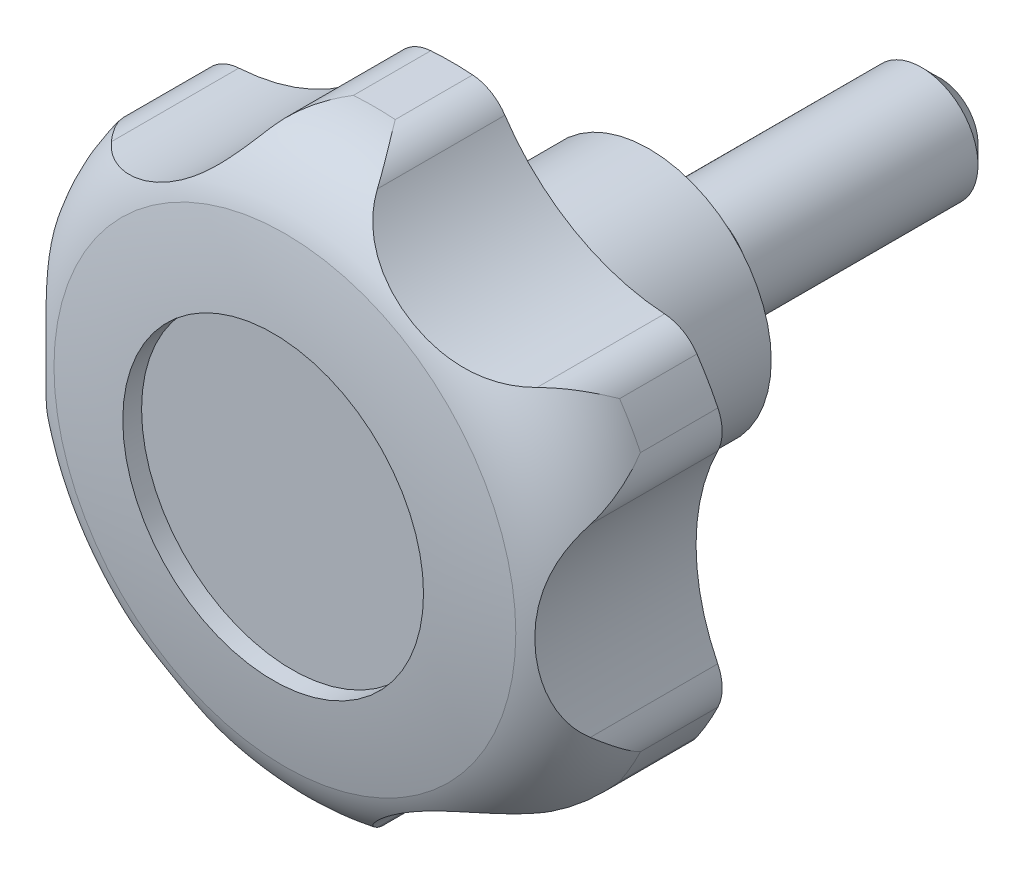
ISO-10303-21;
HEADER;
FILE_DESCRIPTION(('STEP AP214'),'2;1');
FILE_NAME('part.step','',(''),(''),'','','');
FILE_SCHEMA(('AUTOMOTIVE_DESIGN { 1 0 10303 214 1 1 1 1 }'));
ENDSEC;
DATA;
#1=APPLICATION_CONTEXT('core data for automotive mechanical design processes');
#2=APPLICATION_PROTOCOL_DEFINITION('international standard','automotive_design',2000,#1);
#3=PRODUCT_CONTEXT('',#1,'mechanical');
#4=PRODUCT('Part','Part','',(#3));
#5=PRODUCT_RELATED_PRODUCT_CATEGORY('part','',(#4));
#6=PRODUCT_DEFINITION_FORMATION('','',#4);
#7=PRODUCT_DEFINITION_CONTEXT('part definition',#1,'design');
#8=PRODUCT_DEFINITION('design','',#6,#7);
#9=PRODUCT_DEFINITION_SHAPE('','',#8);
#10=(LENGTH_UNIT() NAMED_UNIT(*) SI_UNIT(.MILLI.,.METRE.));
#11=(NAMED_UNIT(*) PLANE_ANGLE_UNIT() SI_UNIT($,.RADIAN.));
#12=(NAMED_UNIT(*) SI_UNIT($,.STERADIAN.) SOLID_ANGLE_UNIT());
#13=UNCERTAINTY_MEASURE_WITH_UNIT(LENGTH_MEASURE(1.E-05),#10,'distance_accuracy_value','');
#14=(GEOMETRIC_REPRESENTATION_CONTEXT(3) GLOBAL_UNCERTAINTY_ASSIGNED_CONTEXT((#13)) GLOBAL_UNIT_ASSIGNED_CONTEXT((#10,
#11,#12)) REPRESENTATION_CONTEXT('',''));
#15=CARTESIAN_POINT('',(0.,0.,0.));
#16=DIRECTION('',(0.,0.,1.));
#17=DIRECTION('',(1.,0.,0.));
#18=AXIS2_PLACEMENT_3D('',#15,#16,#17);
#19=CARTESIAN_POINT('',(0.,0.,49.3400174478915));
#20=DIRECTION('',(0.,0.,1.));
#21=DIRECTION('',(-1.,0.,0.));
#22=AXIS2_PLACEMENT_3D('',#19,#20,#21);
#23=CYLINDRICAL_SURFACE('',#22,31.5);
#24=CARTESIAN_POINT('',(0.,0.,22.));
#25=DIRECTION('',(0.,0.,1.));
#26=DIRECTION('',(-1.,0.,0.));
#27=AXIS2_PLACEMENT_3D('',#24,#25,#26);
#28=CIRCLE('',#27,31.5);
#29=CARTESIAN_POINT('',(26.0979777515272,-17.639318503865,22.));
#30=VERTEX_POINT('',#29);
#31=CARTESIAN_POINT('',(28.3250868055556,-13.7818524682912,22.));
#32=VERTEX_POINT('',#31);
#33=EDGE_CURVE('E472',#30,#32,#28,.T.);
#34=ORIENTED_EDGE('',*,*,#33,.T.);
#35=DIRECTION('',(0.,0.,1.));
#36=VECTOR('',#35,1.);
#37=CARTESIAN_POINT('',(28.3250868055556,-13.7818524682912,-29.));
#38=LINE('',#37,#36);
#39=CARTESIAN_POINT('',(28.3250868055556,-13.7818524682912,30.232767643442));
#40=VERTEX_POINT('',#39);
#41=EDGE_CURVE('E182',#32,#40,#38,.T.);
#42=ORIENTED_EDGE('',*,*,#41,.T.);
#43=CARTESIAN_POINT('',(0.,0.,30.232767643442));
#44=DIRECTION('',(0.,0.,1.));
#45=DIRECTION('',(-1.,0.,0.));
#46=AXIS2_PLACEMENT_3D('',#43,#44,#45);
#47=CIRCLE('',#46,31.5);
#48=CARTESIAN_POINT('',(26.0979777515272,-17.639318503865,30.232767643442));
#49=VERTEX_POINT('',#48);
#50=EDGE_CURVE('E198',#49,#40,#47,.T.);
#51=ORIENTED_EDGE('',*,*,#50,.F.);
#52=DIRECTION('',(0.,0.,1.));
#53=VECTOR('',#52,1.);
#54=CARTESIAN_POINT('',(26.0979777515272,-17.639318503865,-29.));
#55=LINE('',#54,#53);
#56=EDGE_CURVE('E618',#30,#49,#55,.T.);
#57=ORIENTED_EDGE('',*,*,#56,.F.);
#58=EDGE_LOOP('',(#34,#42,#51,#57));
#59=FACE_BOUND('',#58,.T.);
#60=ADVANCED_FACE('F14',(#59),#23,.T.);
#61=CARTESIAN_POINT('',(-2.22710905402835,-31.421170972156,22.));
#62=VERTEX_POINT('',#61);
#63=CARTESIAN_POINT('',(2.22710905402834,-31.421170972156,22.));
#64=VERTEX_POINT('',#63);
#65=EDGE_CURVE('E475',#62,#64,#28,.T.);
#66=ORIENTED_EDGE('',*,*,#65,.T.);
#67=DIRECTION('',(0.,0.,1.));
#68=VECTOR('',#67,1.);
#69=CARTESIAN_POINT('',(2.22710905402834,-31.421170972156,-29.));
#70=LINE('',#69,#68);
#71=CARTESIAN_POINT('',(2.22710905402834,-31.421170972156,30.232767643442));
#72=VERTEX_POINT('',#71);
#73=EDGE_CURVE('E610',#64,#72,#70,.T.);
#74=ORIENTED_EDGE('',*,*,#73,.T.);
#75=CARTESIAN_POINT('',(-2.22710905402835,-31.421170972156,30.232767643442));
#76=VERTEX_POINT('',#75);
#77=EDGE_CURVE('E489',#76,#72,#47,.T.);
#78=ORIENTED_EDGE('',*,*,#77,.F.);
#79=DIRECTION('',(0.,0.,1.));
#80=VECTOR('',#79,1.);
#81=CARTESIAN_POINT('',(-2.22710905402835,-31.421170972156,-29.));
#82=LINE('',#81,#80);
#83=EDGE_CURVE('E608',#62,#76,#82,.T.);
#84=ORIENTED_EDGE('',*,*,#83,.F.);
#85=EDGE_LOOP('',(#66,#74,#78,#84));
#86=FACE_BOUND('',#85,.T.);
#87=ADVANCED_FACE('F438',(#86),#23,.T.);
#88=CARTESIAN_POINT('',(-28.3250868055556,-13.7818524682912,22.));
#89=VERTEX_POINT('',#88);
#90=CARTESIAN_POINT('',(-26.0979777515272,-17.639318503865,22.));
#91=VERTEX_POINT('',#90);
#92=EDGE_CURVE('E478',#89,#91,#28,.T.);
#93=ORIENTED_EDGE('',*,*,#92,.T.);
#94=DIRECTION('',(0.,0.,1.));
#95=VECTOR('',#94,1.);
#96=CARTESIAN_POINT('',(-26.0979777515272,-17.639318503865,-29.));
#97=LINE('',#96,#95);
#98=CARTESIAN_POINT('',(-26.0979777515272,-17.639318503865,30.232767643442));
#99=VERTEX_POINT('',#98);
#100=EDGE_CURVE('E599',#91,#99,#97,.T.);
#101=ORIENTED_EDGE('',*,*,#100,.T.);
#102=CARTESIAN_POINT('',(-28.3250868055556,-13.7818524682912,30.232767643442));
#103=VERTEX_POINT('',#102);
#104=EDGE_CURVE('E485',#103,#99,#47,.T.);
#105=ORIENTED_EDGE('',*,*,#104,.F.);
#106=DIRECTION('',(0.,0.,1.));
#107=VECTOR('',#106,1.);
#108=CARTESIAN_POINT('',(-28.3250868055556,-13.7818524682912,-29.));
#109=LINE('',#108,#107);
#110=EDGE_CURVE('E593',#89,#103,#109,.T.);
#111=ORIENTED_EDGE('',*,*,#110,.F.);
#112=EDGE_LOOP('',(#93,#101,#105,#111));
#113=FACE_BOUND('',#112,.T.);
#114=ADVANCED_FACE('F446',(#113),#23,.T.);
#115=CARTESIAN_POINT('',(-26.0979777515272,17.639318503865,22.));
#116=VERTEX_POINT('',#115);
#117=CARTESIAN_POINT('',(-28.3250868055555,13.7818524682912,22.));
#118=VERTEX_POINT('',#117);
#119=EDGE_CURVE('E477',#116,#118,#28,.T.);
#120=ORIENTED_EDGE('',*,*,#119,.T.);
#121=DIRECTION('',(0.,0.,1.));
#122=VECTOR('',#121,1.);
#123=CARTESIAN_POINT('',(-28.3250868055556,13.7818524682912,-29.));
#124=LINE('',#123,#122);
#125=CARTESIAN_POINT('',(-28.3250868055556,13.7818524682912,30.232767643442));
#126=VERTEX_POINT('',#125);
#127=EDGE_CURVE('E37',#118,#126,#124,.T.);
#128=ORIENTED_EDGE('',*,*,#127,.T.);
#129=CARTESIAN_POINT('',(-26.0979777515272,17.639318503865,30.232767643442));
#130=VERTEX_POINT('',#129);
#131=EDGE_CURVE('E482',#130,#126,#47,.T.);
#132=ORIENTED_EDGE('',*,*,#131,.F.);
#133=DIRECTION('',(0.,0.,1.));
#134=VECTOR('',#133,1.);
#135=CARTESIAN_POINT('',(-26.0979777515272,17.639318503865,-29.));
#136=LINE('',#135,#134);
#137=EDGE_CURVE('E580',#116,#130,#136,.T.);
#138=ORIENTED_EDGE('',*,*,#137,.F.);
#139=EDGE_LOOP('',(#120,#128,#132,#138));
#140=FACE_BOUND('',#139,.T.);
#141=ADVANCED_FACE('F459',(#140),#23,.T.);
#142=CARTESIAN_POINT('',(2.22710905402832,31.4211709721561,22.));
#143=VERTEX_POINT('',#142);
#144=CARTESIAN_POINT('',(-2.22710905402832,31.4211709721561,22.));
#145=VERTEX_POINT('',#144);
#146=EDGE_CURVE('E473',#143,#145,#28,.T.);
#147=ORIENTED_EDGE('',*,*,#146,.T.);
#148=DIRECTION('',(0.,0.,1.));
#149=VECTOR('',#148,1.);
#150=CARTESIAN_POINT('',(-2.22710905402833,31.4211709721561,-29.));
#151=LINE('',#150,#149);
#152=CARTESIAN_POINT('',(-2.22710905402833,31.4211709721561,30.232767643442));
#153=VERTEX_POINT('',#152);
#154=EDGE_CURVE('E634',#145,#153,#151,.T.);
#155=ORIENTED_EDGE('',*,*,#154,.T.);
#156=CARTESIAN_POINT('',(2.22710905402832,31.4211709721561,30.232767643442));
#157=VERTEX_POINT('',#156);
#158=EDGE_CURVE('E645',#157,#153,#47,.T.);
#159=ORIENTED_EDGE('',*,*,#158,.F.);
#160=DIRECTION('',(0.,0.,1.));
#161=VECTOR('',#160,1.);
#162=CARTESIAN_POINT('',(2.22710905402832,31.4211709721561,-29.));
#163=LINE('',#162,#161);
#164=EDGE_CURVE('E632',#143,#157,#163,.T.);
#165=ORIENTED_EDGE('',*,*,#164,.F.);
#166=EDGE_LOOP('',(#147,#155,#159,#165));
#167=FACE_BOUND('',#166,.T.);
#168=ADVANCED_FACE('F451',(#167),#23,.T.);
#169=CARTESIAN_POINT('',(28.3250868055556,13.7818524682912,22.));
#170=VERTEX_POINT('',#169);
#171=CARTESIAN_POINT('',(26.0979777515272,17.639318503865,22.));
#172=VERTEX_POINT('',#171);
#173=EDGE_CURVE('E465',#170,#172,#28,.T.);
#174=ORIENTED_EDGE('',*,*,#173,.T.);
#175=DIRECTION('',(0.,0.,1.));
#176=VECTOR('',#175,1.);
#177=CARTESIAN_POINT('',(26.0979777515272,17.639318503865,-29.));
#178=LINE('',#177,#176);
#179=CARTESIAN_POINT('',(26.0979777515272,17.639318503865,30.232767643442));
#180=VERTEX_POINT('',#179);
#181=EDGE_CURVE('E467',#172,#180,#178,.T.);
#182=ORIENTED_EDGE('',*,*,#181,.T.);
#183=CARTESIAN_POINT('',(28.3250868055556,13.7818524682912,30.232767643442));
#184=VERTEX_POINT('',#183);
#185=EDGE_CURVE('E647',#184,#180,#47,.T.);
#186=ORIENTED_EDGE('',*,*,#185,.F.);
#187=DIRECTION('',(0.,0.,1.));
#188=VECTOR('',#187,1.);
#189=CARTESIAN_POINT('',(28.3250868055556,13.7818524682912,-29.));
#190=LINE('',#189,#188);
#191=EDGE_CURVE('E469',#170,#184,#190,.T.);
#192=ORIENTED_EDGE('',*,*,#191,.F.);
#193=EDGE_LOOP('',(#174,#182,#186,#192));
#194=FACE_BOUND('',#193,.T.);
#195=ADVANCED_FACE('F440',(#194),#23,.T.);
#196=CARTESIAN_POINT('',(0.,0.,-38.6710520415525));
#197=DIRECTION('',(0.,0.,1.));
#198=DIRECTION('',(-1.,0.,0.));
#199=AXIS2_PLACEMENT_3D('',#196,#197,#198);
#200=DEGENERATE_TOROIDAL_SURFACE('',#199,8.75269245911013,80.,.T.);
#201=CARTESIAN_POINT('',(0.,0.,39.7494018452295));
#202=DIRECTION('',(0.,0.,1.));
#203=DIRECTION('',(-1.,0.,0.));
#204=AXIS2_PLACEMENT_3D('',#201,#202,#203);
#205=CIRCLE('',#204,24.5714285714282);
#206=CARTESIAN_POINT('',(-24.5714285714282,0.,39.7494018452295));
#207=VERTEX_POINT('',#206);
#208=EDGE_CURVE('E488',#207,#207,#205,.T.);
#209=ORIENTED_EDGE('',*,*,#208,.T.);
#210=EDGE_LOOP('',(#209));
#211=FACE_BOUND('',#210,.T.);
#212=CARTESIAN_POINT('',(0.,0.,41.));
#213=DIRECTION('',(0.,0.,-1.));
#214=DIRECTION('',(1.,0.,0.));
#215=AXIS2_PLACEMENT_3D('',#212,#213,#214);
#216=CIRCLE('',#215,16.);
#217=CARTESIAN_POINT('',(16.,0.,41.));
#218=VERTEX_POINT('',#217);
#219=EDGE_CURVE('E914',#218,#218,#216,.T.);
#220=ORIENTED_EDGE('',*,*,#219,.T.);
#221=EDGE_LOOP('',(#220));
#222=FACE_BOUND('',#221,.T.);
#223=ADVANCED_FACE('F450',(#211,#222),#200,.T.);
#224=CARTESIAN_POINT('',(0.,0.,30.232767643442));
#225=DIRECTION('',(0.,0.,1.));
#226=DIRECTION('',(-1.,0.,0.));
#227=AXIS2_PLACEMENT_3D('',#224,#225,#226);
#228=TOROIDAL_SURFACE('',#227,21.5,10.0000000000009);
#229=CARTESIAN_POINT('',(26.0979777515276,-17.6393185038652,30.232767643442));
#230=CARTESIAN_POINT('',(26.095787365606,-17.642559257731,30.2381661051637));
#231=CARTESIAN_POINT('',(26.0935927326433,-17.6457971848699,30.2435646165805));
#232=CARTESIAN_POINT('',(25.9715048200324,-17.8254189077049,30.5433082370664));
#233=CARTESIAN_POINT('',(25.8390070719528,-17.9933768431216,30.8377892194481));
#234=CARTESIAN_POINT('',(25.5505586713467,-18.3097081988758,31.4258443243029));
#235=CARTESIAN_POINT('',(25.3945993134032,-18.4580743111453,31.7194180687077));
#236=CARTESIAN_POINT('',(25.0606133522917,-18.7326906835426,32.3051183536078));
#237=CARTESIAN_POINT('',(24.8825534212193,-18.8589068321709,32.5972420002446));
#238=CARTESIAN_POINT('',(24.506441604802,-19.085843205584,33.1782260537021));
#239=CARTESIAN_POINT('',(24.3084021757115,-19.1865791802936,33.4670883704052));
#240=CARTESIAN_POINT('',(23.8777210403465,-19.3661170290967,34.0631220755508));
#241=CARTESIAN_POINT('',(23.6435822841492,-19.4425638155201,34.3699417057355));
#242=CARTESIAN_POINT('',(23.2789979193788,-19.5283534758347,34.8243186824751));
#243=CARTESIAN_POINT('',(23.15532869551,-19.5521302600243,34.9747023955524));
#244=CARTESIAN_POINT('',(22.9038337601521,-19.5894090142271,35.2733876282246));
#245=CARTESIAN_POINT('',(22.776005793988,-19.6029053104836,35.4216879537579));
#246=CARTESIAN_POINT('',(22.6463394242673,-19.610904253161,35.56876104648));
#247=B_SPLINE_CURVE_WITH_KNOTS('',3,(#229,#230,#231,#232,#233,#234,#235,#236,#237,#238,#239,
#240,#241,#242,#243,#244,#245,#246),.UNSPECIFIED.,.F.,.F.,(4,2,2,2,2,2,2,2,4),(0.,
0.0200000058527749,1.11045859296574,2.20132279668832,3.29385249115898,4.3857052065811,
5.56362960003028,6.15179568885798,6.74028614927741),.UNSPECIFIED.);
#248=CARTESIAN_POINT('',(22.6465394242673,-19.610891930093,35.5685341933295));
#249=VERTEX_POINT('',#248);
#250=EDGE_CURVE('E200',#49,#249,#247,.T.);
#251=ORIENTED_EDGE('',*,*,#250,.F.);
#252=ORIENTED_EDGE('',*,*,#50,.T.);
#253=CARTESIAN_POINT('',(28.3067007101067,-9.8068324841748,35.5687871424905));
#254=CARTESIAN_POINT('',(28.3508912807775,-9.89556849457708,35.4565618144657));
#255=CARTESIAN_POINT('',(28.3917729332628,-9.98498886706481,35.343612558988));
#256=CARTESIAN_POINT('',(28.4670914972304,-10.1648549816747,35.1164224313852));
#257=CARTESIAN_POINT('',(28.5015295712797,-10.2553005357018,35.002181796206));
#258=CARTESIAN_POINT('',(28.5953953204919,-10.5275208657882,34.6579333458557));
#259=CARTESIAN_POINT('',(28.6454651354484,-10.7103641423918,34.4261663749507));
#260=CARTESIAN_POINT('',(28.7218108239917,-11.0760554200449,33.9595965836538));
#261=CARTESIAN_POINT('',(28.7481337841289,-11.258902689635,33.7248007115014));
#262=CARTESIAN_POINT('',(28.7783405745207,-11.6229783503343,33.2525284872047));
#263=CARTESIAN_POINT('',(28.7822209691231,-11.8042064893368,33.0150517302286));
#264=CARTESIAN_POINT('',(28.7634739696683,-12.2980890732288,32.3589883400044));
#265=CARTESIAN_POINT('',(28.718758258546,-12.6072648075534,31.9382841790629));
#266=CARTESIAN_POINT('',(28.5687108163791,-13.2060043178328,31.0945771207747));
#267=CARTESIAN_POINT('',(28.4634632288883,-13.4955946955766,30.6715782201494));
#268=CARTESIAN_POINT('',(28.3285049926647,-13.7748156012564,30.2435645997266));
#269=CARTESIAN_POINT('',(28.3267981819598,-13.7783351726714,30.2381660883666));
#270=CARTESIAN_POINT('',(28.325086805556,-13.7818524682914,30.232767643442));
#271=B_SPLINE_CURVE_WITH_KNOTS('',3,(#253,#254,#255,#256,#257,#258,#259,#260,#261,#262,#263,
#264,#265,#266,#267,#268,#269,#270),.UNSPECIFIED.,.F.,.F.,(4,2,2,2,2,2,2,2,4),(0.,
0.44912357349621,0.898166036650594,1.79532231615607,2.69069573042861,3.58620621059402,
5.15403517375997,6.71968999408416,6.73968999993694),.UNSPECIFIED.);
#272=CARTESIAN_POINT('',(28.3068003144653,-9.8070324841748,35.5685341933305));
#273=VERTEX_POINT('',#272);
#274=EDGE_CURVE('E186',#273,#40,#271,.T.);
#275=ORIENTED_EDGE('',*,*,#274,.F.);
#276=CARTESIAN_POINT('',(28.306899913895,-9.80723248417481,35.5682812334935));
#277=CARTESIAN_POINT('',(28.2673881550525,-9.72789258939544,35.6686385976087));
#278=CARTESIAN_POINT('',(28.227286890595,-9.64616596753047,35.7668454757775));
#279=CARTESIAN_POINT('',(28.1461835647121,-9.47811588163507,35.9588369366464));
#280=CARTESIAN_POINT('',(28.1051815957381,-9.39179288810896,36.0526219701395));
#281=CARTESIAN_POINT('',(27.9813412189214,-9.12640847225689,36.326945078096));
#282=CARTESIAN_POINT('',(27.8975600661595,-8.94071625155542,36.5007229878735));
#283=CARTESIAN_POINT('',(27.7306770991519,-8.55559108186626,36.8277600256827));
#284=CARTESIAN_POINT('',(27.6475773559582,-8.3563223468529,36.9812149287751));
#285=CARTESIAN_POINT('',(27.4831867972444,-7.94415498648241,37.2697558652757));
#286=CARTESIAN_POINT('',(27.4018963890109,-7.73125333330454,37.4048377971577));
#287=CARTESIAN_POINT('',(27.2432790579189,-7.29467382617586,37.656528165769));
#288=CARTESIAN_POINT('',(27.1659377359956,-7.07104190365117,37.7732075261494));
#289=CARTESIAN_POINT('',(27.0164001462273,-6.61410095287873,37.9895642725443));
#290=CARTESIAN_POINT('',(26.944203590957,-6.38079246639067,38.0892426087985));
#291=CARTESIAN_POINT('',(26.8060036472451,-5.90558258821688,38.2729593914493));
#292=CARTESIAN_POINT('',(26.7400171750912,-5.66366006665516,38.356955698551));
#293=CARTESIAN_POINT('',(26.6154160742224,-5.17335643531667,38.5102592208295));
#294=CARTESIAN_POINT('',(26.556802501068,-4.92497440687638,38.5795643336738));
#295=CARTESIAN_POINT('',(26.4181661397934,-4.28729101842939,38.7386967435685));
#296=CARTESIAN_POINT('',(26.3437188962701,-3.89445767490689,38.8193385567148));
#297=CARTESIAN_POINT('',(26.215895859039,-3.1007499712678,38.9533643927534));
#298=CARTESIAN_POINT('',(26.1625301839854,-2.69987184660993,39.0067353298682));
#299=CARTESIAN_POINT('',(26.0777773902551,-1.8924390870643,39.0898241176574));
#300=CARTESIAN_POINT('',(26.0464425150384,-1.4858732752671,39.1194857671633));
#301=CARTESIAN_POINT('',(26.0064401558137,-0.67071626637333,39.1571359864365));
#302=CARTESIAN_POINT('',(25.9977694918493,-0.262125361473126,39.1651275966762));
#303=CARTESIAN_POINT('',(26.0032673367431,0.564334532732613,39.1600141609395));
#304=CARTESIAN_POINT('',(26.0179744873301,0.982197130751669,39.1464115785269));
#305=CARTESIAN_POINT('',(26.0710365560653,1.81513174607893,39.0960704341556));
#306=CARTESIAN_POINT('',(26.1093958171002,2.23020323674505,39.0593276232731));
#307=CARTESIAN_POINT('',(26.2090070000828,3.0535519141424,38.9600301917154));
#308=CARTESIAN_POINT('',(26.2702065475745,3.46184242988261,38.8975345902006));
#309=CARTESIAN_POINT('',(26.414233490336,4.26876333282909,38.7425858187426));
#310=CARTESIAN_POINT('',(26.4970492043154,4.66739881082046,38.6501488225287));
#311=CARTESIAN_POINT('',(26.6518972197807,5.32280567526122,38.466128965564));
#312=CARTESIAN_POINT('',(26.7186645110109,5.58351647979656,38.3840627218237));
#313=CARTESIAN_POINT('',(26.8599386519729,6.09659869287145,38.2024669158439));
#314=CARTESIAN_POINT('',(26.93444315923,6.34897259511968,38.1029426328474));
#315=CARTESIAN_POINT('',(27.0896194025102,6.84271708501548,37.8852972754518));
#316=CARTESIAN_POINT('',(27.1702731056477,7.0841167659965,37.7672295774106));
#317=CARTESIAN_POINT('',(27.3362070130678,7.5544558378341,37.5111726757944));
#318=CARTESIAN_POINT('',(27.4214863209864,7.78339762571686,37.3731873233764));
#319=CARTESIAN_POINT('',(27.574314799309,8.17463300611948,37.1113840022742));
#320=CARTESIAN_POINT('',(27.6413411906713,8.33998254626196,36.9918111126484));
#321=CARTESIAN_POINT('',(27.7758194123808,8.66099232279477,36.7405668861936));
#322=CARTESIAN_POINT('',(27.8432711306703,8.81665500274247,36.6088986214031));
#323=CARTESIAN_POINT('',(27.9779423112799,9.11836971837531,36.3326466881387));
#324=CARTESIAN_POINT('',(28.0451570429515,9.26434887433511,36.1879809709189));
#325=CARTESIAN_POINT('',(28.177732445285,9.54473083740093,35.8868532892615));
#326=CARTESIAN_POINT('',(28.2430918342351,9.679125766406,35.7303834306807));
#327=CARTESIAN_POINT('',(28.306899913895,9.807232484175,35.5682812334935));
#328=B_SPLINE_CURVE_WITH_KNOTS('',3,(#276,#277,#278,#279,#280,#281,#282,#283,#284,#285,#286,
#287,#288,#289,#290,#291,#292,#293,#294,#295,#296,#297,#298,#299,#300,#301,#302,#303,#304,#305,
#306,#307,#308,#309,#310,#311,#312,#313,#314,#315,#316,#317,#318,#319,#320,#321,#322,#323,#324,
#325,#326,#327),.UNSPECIFIED.,.F.,.F.,(4,2,2,2,2,2,2,2,2,2,2,2,2,2,2,2,2,2,2,2,2,2,2,2,2,4),(0.,
0.401597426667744,0.803153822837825,1.60518118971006,2.39881165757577,3.19261900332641,
3.98328802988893,4.77391284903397,5.56663251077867,6.35946553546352,7.5812750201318,
8.80367023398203,10.028954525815,11.2540668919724,12.5078182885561,13.7617999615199,
15.0129236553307,16.2633726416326,17.1067811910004,17.9499351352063,18.7907051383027,
19.6313127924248,20.2751395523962,20.9188032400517,21.566861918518,22.2153579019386),.UNSPECIFIED.);
#329=CARTESIAN_POINT('',(28.3068003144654,9.80703248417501,35.5685341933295));
#330=VERTEX_POINT('',#329);
#331=EDGE_CURVE('E174',#273,#330,#328,.T.);
#332=ORIENTED_EDGE('',*,*,#331,.T.);
#333=CARTESIAN_POINT('',(28.325086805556,13.7818524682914,30.232767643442));
#334=CARTESIAN_POINT('',(28.3267981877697,13.7783351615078,30.2381661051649));
#335=CARTESIAN_POINT('',(28.3285049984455,13.7748155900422,30.2435646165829));
#336=CARTESIAN_POINT('',(28.4230180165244,13.5792734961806,30.5433082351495));
#337=CARTESIAN_POINT('',(28.5022249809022,13.3805481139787,30.83778921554));
#338=CARTESIAN_POINT('',(28.6319517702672,12.9725787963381,31.4258443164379));
#339=CARTESIAN_POINT('',(28.682460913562,12.763330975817,31.7194180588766));
#340=CARTESIAN_POINT('',(28.7532926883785,12.3367824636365,32.3051183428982));
#341=CARTESIAN_POINT('',(28.7735691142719,12.1194699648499,32.5972419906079));
#342=CARTESIAN_POINT('',(28.7820458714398,11.68027938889,33.1782260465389));
#343=CARTESIAN_POINT('',(28.7702660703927,11.4584042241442,33.4670883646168));
#344=CARTESIAN_POINT('',(28.7104093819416,10.995650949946,34.0631266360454));
#345=CARTESIAN_POINT('',(28.6595438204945,10.7546538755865,34.369950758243));
#346=CARTESIAN_POINT('',(28.551545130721,10.3960145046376,34.8243342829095));
#347=CARTESIAN_POINT('',(28.5103008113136,10.2770237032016,34.9747201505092));
#348=CARTESIAN_POINT('',(28.4168353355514,10.0405799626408,35.2734096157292));
#349=CARTESIAN_POINT('',(28.364608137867,9.92312790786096,35.4217120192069));
#350=CARTESIAN_POINT('',(28.3067007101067,9.80683248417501,35.5687871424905));
#351=B_SPLINE_CURVE_WITH_KNOTS('',3,(#333,#334,#335,#336,#337,#338,#339,#340,#341,#342,#343,
#344,#345,#346,#347,#348,#349,#350),.UNSPECIFIED.,.F.,.F.,(4,2,2,2,2,2,2,2,4),(0.,
0.0200000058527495,1.11045858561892,2.20132278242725,3.29385247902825,4.38570520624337,
5.56364695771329,6.15182175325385,6.74032093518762),.UNSPECIFIED.);
#352=EDGE_CURVE('E181',#184,#330,#351,.T.);
#353=ORIENTED_EDGE('',*,*,#352,.F.);
#354=ORIENTED_EDGE('',*,*,#185,.T.);
#355=CARTESIAN_POINT('',(22.6463394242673,19.610904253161,35.56876104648));
#356=CARTESIAN_POINT('',(22.7452824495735,19.6048058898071,35.456535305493));
#357=CARTESIAN_POINT('',(22.8431636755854,19.5954997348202,35.3435856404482));
#358=CARTESIAN_POINT('',(23.0365917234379,19.5707934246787,35.1163947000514));
#359=CARTESIAN_POINT('',(23.1321389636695,19.555394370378,35.0021536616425));
#360=CARTESIAN_POINT('',(23.4148216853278,19.5005727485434,34.6579040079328));
#361=CARTESIAN_POINT('',(23.5982035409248,19.4525117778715,34.4261362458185));
#362=CARTESIAN_POINT('',(23.953074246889,19.3357813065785,33.959564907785));
#363=CARTESIAN_POINT('',(24.1245860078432,19.2671529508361,33.7247682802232));
#364=CARTESIAN_POINT('',(24.4549878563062,19.1112728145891,33.2524945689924));
#365=CARTESIAN_POINT('',(24.6138760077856,19.0240181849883,33.015017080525));
#366=CARTESIAN_POINT('',(25.0322121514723,18.7608413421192,32.3589586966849));
#367=CARTESIAN_POINT('',(25.2776039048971,18.5675303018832,31.938260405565));
#368=CARTESIAN_POINT('',(25.7210962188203,18.1382205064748,31.0945651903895));
#369=CARTESIAN_POINT('',(25.9192618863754,17.9022813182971,30.6715722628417));
#370=CARTESIAN_POINT('',(26.0935927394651,17.6457971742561,30.2435645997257));
#371=CARTESIAN_POINT('',(26.095787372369,17.6425592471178,30.2381660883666));
#372=CARTESIAN_POINT('',(26.0979777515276,17.6393185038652,30.232767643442));
#373=B_SPLINE_CURVE_WITH_KNOTS('',3,(#355,#356,#357,#358,#359,#360,#361,#362,#363,#364,#365,
#366,#367,#368,#369,#370,#371,#372),.UNSPECIFIED.,.F.,.F.,(4,2,2,2,2,2,2,2,4),(0.,
0.449124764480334,0.89816841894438,1.7953270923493,2.6907028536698,3.58621567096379,
5.15402250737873,6.71965525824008,6.73965526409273),.UNSPECIFIED.);
#374=CARTESIAN_POINT('',(22.6465394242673,19.610891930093,35.56853419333));
#375=VERTEX_POINT('',#374);
#376=EDGE_CURVE('E248',#375,#180,#373,.T.);
#377=ORIENTED_EDGE('',*,*,#376,.F.);
#378=CARTESIAN_POINT('',(22.6467394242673,19.6108796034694,35.5683073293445));
#379=CARTESIAN_POINT('',(22.5582725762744,19.6163314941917,35.6686645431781));
#380=CARTESIAN_POINT('',(22.4674440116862,19.6224662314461,35.7668712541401));
#381=CARTESIAN_POINT('',(22.2813555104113,19.6362540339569,35.9588623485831));
#382=CARTESIAN_POINT('',(22.1860960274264,19.6439069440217,36.0526471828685));
#383=CARTESIAN_POINT('',(21.8943444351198,19.6693507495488,36.3269696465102));
#384=CARTESIAN_POINT('',(21.6916385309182,19.6896406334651,36.5007470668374));
#385=CARTESIAN_POINT('',(21.2746666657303,19.7376791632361,36.8277830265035));
#386=CARTESIAN_POINT('',(21.0605439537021,19.7653474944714,36.9812373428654));
#387=CARTESIAN_POINT('',(20.6213992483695,19.8290657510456,37.2697770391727));
#388=CARTESIAN_POINT('',(20.3963748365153,19.8651175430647,37.4048583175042));
#389=CARTESIAN_POINT('',(19.9389754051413,19.9460417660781,37.6565473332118));
#390=CARTESIAN_POINT('',(19.7066329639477,19.9908787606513,37.7732259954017));
#391=CARTESIAN_POINT('',(19.2361400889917,20.0898471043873,37.989581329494));
#392=CARTESIAN_POINT('',(18.9979899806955,20.1439779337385,38.0892589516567));
#393=CARTESIAN_POINT('',(18.5173447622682,20.2618995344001,38.2729743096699));
#394=CARTESIAN_POINT('',(18.2748398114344,20.3257155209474,38.3569699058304));
#395=CARTESIAN_POINT('',(17.787922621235,20.4629610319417,38.5102720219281));
#396=CARTESIAN_POINT('',(17.5435101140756,20.5363919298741,38.5795764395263));
#397=CARTESIAN_POINT('',(16.9219401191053,20.7351730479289,38.7387072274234));
#398=CARTESIAN_POINT('',(16.5445116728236,20.8671178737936,38.8193480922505));
#399=CARTESIAN_POINT('',(15.793226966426,21.1532765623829,38.9533720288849));
#400=CARTESIAN_POINT('',(15.419372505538,21.3075010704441,39.0067420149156));
#401=CARTESIAN_POINT('',(14.6777370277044,21.6378224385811,39.0898288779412));
#402=CARTESIAN_POINT('',(14.3099724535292,21.8139701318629,39.1194895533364));
#403=CARTESIAN_POINT('',(13.5840231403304,22.1869088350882,39.1571377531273));
#404=CARTESIAN_POINT('',(13.2258370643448,22.383696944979,39.1651283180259));
#405=CARTESIAN_POINT('',(12.5128497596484,22.8016915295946,39.1600126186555));
#406=CARTESIAN_POINT('',(12.1583233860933,23.0233612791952,39.1464088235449));
#407=CARTESIAN_POINT('',(11.4635114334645,23.4857850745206,39.096065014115));
#408=CARTESIAN_POINT('',(11.1232284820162,23.7265426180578,39.0593207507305));
#409=CARTESIAN_POINT('',(10.4599932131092,24.2244861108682,38.960020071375));
#410=CARTESIAN_POINT('',(10.1370031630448,24.4816333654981,38.8975226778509));
#411=CARTESIAN_POINT('',(9.51020318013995,25.0098279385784,38.7425698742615));
#412=CARTESIAN_POINT('',(9.20638299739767,25.2808676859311,38.6501306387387));
#413=CARTESIAN_POINT('',(8.71621052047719,25.7426742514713,38.466107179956));
#414=CARTESIAN_POINT('',(8.5238139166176,25.9308511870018,38.3840398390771));
#415=CARTESIAN_POINT('',(8.15011259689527,26.3097378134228,38.2024418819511));
#416=CARTESIAN_POINT('',(7.9688045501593,26.5004467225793,38.1029165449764));
#417=CARTESIAN_POINT('',(7.61880117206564,26.8817036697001,37.8852691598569));
#418=CARTESIAN_POINT('',(7.45007162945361,27.07225063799,37.767200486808));
#419=CARTESIAN_POINT('',(7.12571667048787,27.45112090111,37.5111417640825));
#420=CARTESIAN_POINT('',(6.97008873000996,27.639444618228,37.3731555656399));
#421=CARTESIAN_POINT('',(6.70768734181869,27.9674120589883,37.1113519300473));
#422=CARTESIAN_POINT('',(6.59800591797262,28.1081310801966,36.9917796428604));
#423=CARTESIAN_POINT('',(6.38724675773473,28.3850929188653,36.7405369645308));
#424=CARTESIAN_POINT('',(6.28616684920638,28.521336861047,36.6088696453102));
#425=CARTESIAN_POINT('',(6.09221377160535,28.7888183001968,36.3326200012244));
#426=CARTESIAN_POINT('',(5.99940134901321,28.9200152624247,36.1879556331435));
#427=CARTESIAN_POINT('',(5.82287463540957,29.1750154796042,35.8868310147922));
#428=CARTESIAN_POINT('',(5.73916652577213,29.2988136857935,35.730362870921));
#429=CARTESIAN_POINT('',(5.66012837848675,29.4181244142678,35.568262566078));
#430=B_SPLINE_CURVE_WITH_KNOTS('',3,(#378,#379,#380,#381,#382,#383,#384,#385,#386,#387,#388,
#389,#390,#391,#392,#393,#394,#395,#396,#397,#398,#399,#400,#401,#402,#403,#404,#405,#406,#407,
#408,#409,#410,#411,#412,#413,#414,#415,#416,#417,#418,#419,#420,#421,#422,#423,#424,#425,#426,
#427,#428,#429),.UNSPECIFIED.,.F.,.F.,(4,2,2,2,2,2,2,2,2,2,2,2,2,2,2,2,2,2,2,2,2,2,2,2,2,4),(0.,
0.401598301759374,0.803155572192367,1.60518467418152,2.39881681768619,3.19262584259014,
3.9832964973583,4.77392294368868,5.56664425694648,6.3594789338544,7.58129241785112,
8.80369163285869,10.028979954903,11.2540963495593,12.5078513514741,13.7618366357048,
15.0129638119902,16.2634162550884,17.1068205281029,17.9499701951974,18.7907359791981,
19.63133941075,20.2751571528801,20.91881182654,21.5668612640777,22.215347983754),.UNSPECIFIED.);
#431=CARTESIAN_POINT('',(5.66026089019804,29.4179244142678,35.568534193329));
#432=VERTEX_POINT('',#431);
#433=EDGE_CURVE('E254',#375,#432,#430,.T.);
#434=ORIENTED_EDGE('',*,*,#433,.T.);
#435=CARTESIAN_POINT('',(2.22710905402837,31.4211709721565,30.232767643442));
#436=CARTESIAN_POINT('',(2.23101082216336,31.4208944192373,30.2381661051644));
#437=CARTESIAN_POINT('',(2.23491226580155,31.4206127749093,30.2435646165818));
#438=CARTESIAN_POINT('',(2.45151319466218,31.4046924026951,30.5433082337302));
#439=CARTESIAN_POINT('',(2.66321790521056,31.3739249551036,30.8377892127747));
#440=CARTESIAN_POINT('',(3.0813930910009,31.282286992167,31.4258443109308));
#441=CARTESIAN_POINT('',(3.28786158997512,31.2214052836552,31.7194180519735));
#442=CARTESIAN_POINT('',(3.69267932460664,31.0694731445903,32.3051183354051));
#443=CARTESIAN_POINT('',(3.89101568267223,30.9783767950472,32.5972419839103));
#444=CARTESIAN_POINT('',(4.27560425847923,30.7661225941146,33.1782260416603));
#445=CARTESIAN_POINT('',(4.46186388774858,30.6449834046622,33.4670883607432));
#446=CARTESIAN_POINT('',(4.83269366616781,30.3617678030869,34.0631298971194));
#447=CARTESIAN_POINT('',(5.01597231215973,30.1972164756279,34.3699572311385));
#448=CARTESIAN_POINT('',(5.27256609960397,29.9243637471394,34.824345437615));
#449=CARTESIAN_POINT('',(5.35499370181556,29.8291484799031,34.9747328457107));
#450=CARTESIAN_POINT('',(5.51302848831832,29.629980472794,35.2734253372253));
#451=CARTESIAN_POINT('',(5.58863188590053,29.5260229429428,35.4217292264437));
#452=CARTESIAN_POINT('',(5.66039339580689,29.4177244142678,35.5688058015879));
#453=B_SPLINE_CURVE_WITH_KNOTS('',3,(#435,#436,#437,#438,#439,#440,#441,#442,#443,#444,#445,
#446,#447,#448,#449,#450,#451,#452),.UNSPECIFIED.,.F.,.F.,(4,2,2,2,2,2,2,2,4),(0.,
0.0200000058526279,1.11045858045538,2.20132277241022,3.29385247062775,4.38570520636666,
5.56365936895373,6.15184038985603,6.74034580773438),.UNSPECIFIED.);
#454=EDGE_CURVE('E277',#157,#432,#453,.T.);
#455=ORIENTED_EDGE('',*,*,#454,.F.);
#456=ORIENTED_EDGE('',*,*,#158,.T.);
#457=CARTESIAN_POINT('',(-5.66039339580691,29.4177244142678,35.5688058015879));
#458=CARTESIAN_POINT('',(-5.60564139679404,29.5003626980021,35.4565807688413));
#459=CARTESIAN_POINT('',(-5.54864226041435,29.5804775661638,35.3436318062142));
#460=CARTESIAN_POINT('',(-5.43053361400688,29.7356386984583,35.1164422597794));
#461=CARTESIAN_POINT('',(-5.36942484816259,29.8106858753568,35.0022019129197));
#462=CARTESIAN_POINT('',(-5.18060902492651,30.0280866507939,34.6579543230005));
#463=CARTESIAN_POINT('',(-5.04729767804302,30.1628703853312,34.4261879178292));
#464=CARTESIAN_POINT('',(-4.76877388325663,30.4118341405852,33.9596192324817));
#465=CARTESIAN_POINT('',(-4.62358561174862,30.5260545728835,33.7248239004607));
#466=CARTESIAN_POINT('',(-4.32339145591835,30.7342532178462,33.2525527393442));
#467=CARTESIAN_POINT('',(-4.16838407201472,30.8282283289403,33.0150765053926));
#468=CARTESIAN_POINT('',(-3.73129394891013,31.0589375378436,32.359009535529));
#469=CARTESIAN_POINT('',(-3.44117937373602,31.1748025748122,31.9383011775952));
#470=CARTESIAN_POINT('',(-2.84762630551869,31.3442303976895,31.0945856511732));
#471=CARTESIAN_POINT('',(-2.54420684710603,31.3978793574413,30.6715824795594));
#472=CARTESIAN_POINT('',(-2.23491225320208,31.4206127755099,30.2435645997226));
#473=CARTESIAN_POINT('',(-2.23101080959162,31.4208944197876,30.2381660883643));
#474=CARTESIAN_POINT('',(-2.22710905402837,31.4211709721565,30.232767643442));
#475=B_SPLINE_CURVE_WITH_KNOTS('',3,(#457,#458,#459,#460,#461,#462,#463,#464,#465,#466,#467,
#468,#469,#470,#471,#472,#473,#474),.UNSPECIFIED.,.F.,.F.,(4,2,2,2,2,2,2,2,4),(0.,
0.449122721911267,0.898164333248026,1.79531890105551,2.69069063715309,3.58619944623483,
5.15404423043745,6.71971483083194,6.73971483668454),.UNSPECIFIED.);
#476=CARTESIAN_POINT('',(-5.66026089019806,29.4179244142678,35.56853419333));
#477=VERTEX_POINT('',#476);
#478=EDGE_CURVE('E283',#477,#153,#475,.T.);
#479=ORIENTED_EDGE('',*,*,#478,.F.);
#480=CARTESIAN_POINT('',(-5.66012837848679,29.4181244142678,35.568262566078));
#481=CARTESIAN_POINT('',(-5.70908256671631,29.3442366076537,35.6686200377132));
#482=CARTESIAN_POINT('',(-5.75980896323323,29.268644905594,35.7668270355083));
#483=CARTESIAN_POINT('',(-5.86479233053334,29.1143829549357,35.9588187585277));
#484=CARTESIAN_POINT('',(-5.91904894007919,29.0357130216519,36.0526039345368));
#485=CARTESIAN_POINT('',(-6.0869574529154,28.7957728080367,36.3269275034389));
#486=CARTESIAN_POINT('',(-6.20588041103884,28.6303706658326,36.5007057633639));
#487=CARTESIAN_POINT('',(-6.45596580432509,28.2932842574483,36.8277435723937));
#488=CARTESIAN_POINT('',(-6.58698706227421,28.1216838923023,36.9811988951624));
#489=CARTESIAN_POINT('',(-6.86173785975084,27.7732347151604,37.2697407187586));
#490=CARTESIAN_POINT('',(-7.00547022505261,27.5963847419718,37.4048231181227));
#491=CARTESIAN_POINT('',(-7.30424916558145,27.2407290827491,37.6565144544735));
#492=CARTESIAN_POINT('',(-7.45924876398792,27.0619338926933,37.7731943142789));
#493=CARTESIAN_POINT('',(-7.7802011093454,26.7039606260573,37.9895520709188));
#494=CARTESIAN_POINT('',(-7.94615324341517,26.5247825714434,38.089230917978));
#495=CARTESIAN_POINT('',(-8.28859577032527,26.1674933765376,38.2729487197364));
#496=CARTESIAN_POINT('',(-8.46511292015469,25.9893863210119,38.3569455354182));
#497=CARTESIAN_POINT('',(-8.82742645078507,25.6363270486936,38.5102500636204));
#498=CARTESIAN_POINT('',(-9.0132241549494,25.4613752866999,38.5795556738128));
#499=CARTESIAN_POINT('',(-9.49615408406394,25.022471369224,38.7386892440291));
#500=CARTESIAN_POINT('',(-9.79913285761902,24.7615817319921,38.8193317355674));
#501=CARTESIAN_POINT('',(-10.4225898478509,24.2540302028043,38.9533589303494));
#502=CARTESIAN_POINT('',(-10.7430763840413,24.0073751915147,39.0067305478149));
#503=CARTESIAN_POINT('',(-11.3999547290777,23.5302607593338,39.089820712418));
#504=CARTESIAN_POINT('',(-11.7363823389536,23.2998409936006,39.1194830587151));
#505=CARTESIAN_POINT('',(-12.422325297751,22.8576191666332,39.1571347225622));
#506=CARTESIAN_POINT('',(-12.7718388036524,22.645814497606,39.1651270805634));
#507=CARTESIAN_POINT('',(-13.4903205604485,22.2373452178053,39.1600152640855));
#508=CARTESIAN_POINT('',(-13.8595526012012,22.041150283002,39.1464135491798));
#509=CARTESIAN_POINT('',(-14.6074239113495,21.670635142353,39.096074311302));
#510=CARTESIAN_POINT('',(-14.9860648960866,21.4963189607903,39.0593325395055));
#511=CARTESIAN_POINT('',(-15.7489092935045,21.1709092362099,38.9600374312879));
#512=CARTESIAN_POINT('',(-16.1330980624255,21.0197636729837,38.8975431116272));
#513=CARTESIAN_POINT('',(-16.9039237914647,20.7410327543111,38.7425972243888));
#514=CARTESIAN_POINT('',(-17.290559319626,20.6134347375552,38.6501618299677));
#515=CARTESIAN_POINT('',(-17.9355827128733,20.4198317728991,38.4661445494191));
#516=CARTESIAN_POINT('',(-18.1947496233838,20.3472975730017,38.3840790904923));
#517=CARTESIAN_POINT('',(-18.7097312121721,20.2131016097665,38.2024848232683));
#518=CARTESIAN_POINT('',(-18.9655468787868,20.151436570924,38.1029612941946));
#519=CARTESIAN_POINT('',(-19.4707327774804,20.0389492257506,37.8853173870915));
#520=CARTESIAN_POINT('',(-19.7201191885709,19.9880967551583,37.7672503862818));
#521=CARTESIAN_POINT('',(-20.2104144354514,19.8966287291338,37.5111947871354));
#522=CARTESIAN_POINT('',(-20.4513248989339,19.8560111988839,37.3732100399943));
#523=CARTESIAN_POINT('',(-20.8665614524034,19.7927457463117,37.1114076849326));
#524=CARTESIAN_POINT('',(-21.043272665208,19.7681170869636,36.9918351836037));
#525=CARTESIAN_POINT('',(-21.3885166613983,19.7240729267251,36.7405916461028));
#526=CARTESIAN_POINT('',(-21.5570515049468,19.7046561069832,36.6089236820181));
#527=CARTESIAN_POINT('',(-21.8856820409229,19.6704267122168,36.332672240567));
#528=CARTESIAN_POINT('',(-22.0457122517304,19.6556464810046,36.1880067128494));
#529=CARTESIAN_POINT('',(-22.3548202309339,19.6302685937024,35.886879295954));
#530=CARTESIAN_POINT('',(-22.5038905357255,19.6196737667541,35.7304095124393));
#531=CARTESIAN_POINT('',(-22.6467394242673,19.6108796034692,35.5683073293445));
#532=B_SPLINE_CURVE_WITH_KNOTS('',3,(#480,#481,#482,#483,#484,#485,#486,#487,#488,#489,#490,
#491,#492,#493,#494,#495,#496,#497,#498,#499,#500,#501,#502,#503,#504,#505,#506,#507,#508,#509,
#510,#511,#512,#513,#514,#515,#516,#517,#518,#519,#520,#521,#522,#523,#524,#525,#526,#527,#528,
#529,#530,#531),.UNSPECIFIED.,.F.,.F.,(4,2,2,2,2,2,2,2,2,2,2,2,2,2,2,2,2,2,2,2,2,2,2,2,2,4),(0.,
0.40159680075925,0.803152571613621,1.60517869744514,2.39880796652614,3.19261411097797,
3.98328197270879,4.77390562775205,5.56662410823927,6.35945595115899,7.58126257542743,
8.80365492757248,10.0289363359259,11.254045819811,12.507794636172,13.7617737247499,
15.0128949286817,16.2633414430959,17.1067530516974,17.949910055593,18.790683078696,
19.6312937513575,20.2751227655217,20.918788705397,21.5668497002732,22.2153480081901),.UNSPECIFIED.);
#533=CARTESIAN_POINT('',(-22.6465394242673,19.610891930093,35.5685341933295));
#534=VERTEX_POINT('',#533);
#535=EDGE_CURVE('E289',#477,#534,#532,.T.);
#536=ORIENTED_EDGE('',*,*,#535,.T.);
#537=CARTESIAN_POINT('',(-26.0979777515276,17.6393185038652,30.232767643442));
#538=CARTESIAN_POINT('',(-26.0957873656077,17.6425592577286,30.2381661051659));
#539=CARTESIAN_POINT('',(-26.0935927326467,17.645797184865,30.2435646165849));
#540=CARTESIAN_POINT('',(-25.9715048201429,17.8254189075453,30.5433082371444));
#541=CARTESIAN_POINT('',(-25.8390070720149,17.9933768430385,30.8377892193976));
#542=CARTESIAN_POINT('',(-25.5505586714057,18.3097081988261,31.4258443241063));
#543=CARTESIAN_POINT('',(-25.3945993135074,18.4580743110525,31.7194180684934));
#544=CARTESIAN_POINT('',(-25.0606133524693,18.7326906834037,32.305118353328));
#545=CARTESIAN_POINT('',(-24.8825534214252,18.8589068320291,32.597241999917));
#546=CARTESIAN_POINT('',(-24.5064416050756,19.0858432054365,33.178226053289));
#547=CARTESIAN_POINT('',(-24.3084021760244,19.186579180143,33.4670883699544));
#548=CARTESIAN_POINT('',(-23.8777210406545,19.3661170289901,34.0631220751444));
#549=CARTESIAN_POINT('',(-23.6435822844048,19.4425638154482,34.3699417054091));
#550=CARTESIAN_POINT('',(-23.2789979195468,19.5283534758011,34.8243186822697));
#551=CARTESIAN_POINT('',(-23.1553286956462,19.5521302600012,34.9747023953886));
#552=CARTESIAN_POINT('',(-22.9038337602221,19.5894090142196,35.2733876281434));
#553=CARTESIAN_POINT('',(-22.7760057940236,19.6029053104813,35.4216879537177));
#554=CARTESIAN_POINT('',(-22.6463394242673,19.610904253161,35.56876104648));
#555=B_SPLINE_CURVE_WITH_KNOTS('',3,(#537,#538,#539,#540,#541,#542,#543,#544,#545,#546,#547,
#548,#549,#550,#551,#552,#553,#554),.UNSPECIFIED.,.F.,.F.,(4,2,2,2,2,2,2,2,4),(0.,
0.0200000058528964,1.11045859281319,2.20132279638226,3.29385249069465,4.38570520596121,
5.56362959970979,6.1517956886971,6.7402861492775),.UNSPECIFIED.);
#556=EDGE_CURVE('E296',#130,#534,#555,.T.);
#557=ORIENTED_EDGE('',*,*,#556,.F.);
#558=ORIENTED_EDGE('',*,*,#131,.T.);
#559=CARTESIAN_POINT('',(-28.3067007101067,9.8068324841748,35.5687871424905));
#560=CARTESIAN_POINT('',(-28.3508912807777,9.89556849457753,35.4565618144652));
#561=CARTESIAN_POINT('',(-28.3917729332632,9.98498886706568,35.343612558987));
#562=CARTESIAN_POINT('',(-28.467091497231,10.1648549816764,35.1164224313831));
#563=CARTESIAN_POINT('',(-28.5015295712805,10.255300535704,35.0021817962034));
#564=CARTESIAN_POINT('',(-28.5953953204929,10.5275208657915,34.6579333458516));
#565=CARTESIAN_POINT('',(-28.6454651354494,10.7103641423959,34.4261663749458));
#566=CARTESIAN_POINT('',(-28.7218108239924,11.0760554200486,33.9595965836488));
#567=CARTESIAN_POINT('',(-28.7481337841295,11.2589026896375,33.7248007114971));
#568=CARTESIAN_POINT('',(-28.7783405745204,11.6229783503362,33.2525284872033));
#569=CARTESIAN_POINT('',(-28.7822209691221,11.8042064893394,33.0150517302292));
#570=CARTESIAN_POINT('',(-28.76347396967,12.2980890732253,32.3589883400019));
#571=CARTESIAN_POINT('',(-28.7187582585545,12.6072648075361,31.9382841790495));
#572=CARTESIAN_POINT('',(-28.5687108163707,13.2060043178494,31.0945771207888));
#573=CARTESIAN_POINT('',(-28.4634632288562,13.4955946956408,30.6715782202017));
#574=CARTESIAN_POINT('',(-28.3285049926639,13.7748156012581,30.2435645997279));
#575=CARTESIAN_POINT('',(-28.3267981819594,13.7783351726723,30.2381660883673));
#576=CARTESIAN_POINT('',(-28.325086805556,13.7818524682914,30.232767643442));
#577=B_SPLINE_CURVE_WITH_KNOTS('',3,(#559,#560,#561,#562,#563,#564,#565,#566,#567,#568,#569,
#570,#571,#572,#573,#574,#575,#576),.UNSPECIFIED.,.F.,.F.,(4,2,2,2,2,2,2,2,4),(0.,
0.449123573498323,0.898166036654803,1.79532231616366,2.69069573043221,3.58620621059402,
5.15403517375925,6.71968999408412,6.73968999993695),.UNSPECIFIED.);
#578=CARTESIAN_POINT('',(-28.3068003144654,9.8070324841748,35.56853419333));
#579=VERTEX_POINT('',#578);
#580=EDGE_CURVE('E319',#579,#126,#577,.T.);
#581=ORIENTED_EDGE('',*,*,#580,.F.);
#582=CARTESIAN_POINT('',(-28.306899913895,9.8072324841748,35.5682812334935));
#583=CARTESIAN_POINT('',(-28.2673881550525,9.72789258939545,35.6686385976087));
#584=CARTESIAN_POINT('',(-28.227286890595,9.64616596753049,35.7668454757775));
#585=CARTESIAN_POINT('',(-28.1461835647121,9.47811588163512,35.9588369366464));
#586=CARTESIAN_POINT('',(-28.1051815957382,9.39179288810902,36.0526219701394));
#587=CARTESIAN_POINT('',(-27.9813412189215,9.126408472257,36.3269450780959));
#588=CARTESIAN_POINT('',(-27.8975600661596,8.94071625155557,36.5007229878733));
#589=CARTESIAN_POINT('',(-27.730677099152,8.5555910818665,36.8277600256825));
#590=CARTESIAN_POINT('',(-27.6475773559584,8.3563223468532,36.981214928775));
#591=CARTESIAN_POINT('',(-27.4831867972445,7.94415498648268,37.2697558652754));
#592=CARTESIAN_POINT('',(-27.4018963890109,7.73125333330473,37.4048377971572));
#593=CARTESIAN_POINT('',(-27.2432790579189,7.29467382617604,37.6565281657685));
#594=CARTESIAN_POINT('',(-27.1659377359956,7.07104190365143,37.7732075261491));
#595=CARTESIAN_POINT('',(-27.0164001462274,6.61410095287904,37.9895642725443));
#596=CARTESIAN_POINT('',(-26.9442035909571,6.38079246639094,38.0892426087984));
#597=CARTESIAN_POINT('',(-26.8060036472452,5.90558258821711,38.2729593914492));
#598=CARTESIAN_POINT('',(-26.7400171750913,5.66366006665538,38.3569556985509));
#599=CARTESIAN_POINT('',(-26.6154160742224,5.17335643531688,38.5102592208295));
#600=CARTESIAN_POINT('',(-26.556802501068,4.92497440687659,38.5795643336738));
#601=CARTESIAN_POINT('',(-26.4181661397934,4.28729101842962,38.7386967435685));
#602=CARTESIAN_POINT('',(-26.3437188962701,3.89445767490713,38.8193385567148));
#603=CARTESIAN_POINT('',(-26.2158958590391,3.10074997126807,38.9533643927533));
#604=CARTESIAN_POINT('',(-26.1625301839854,2.69987184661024,39.0067353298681));
#605=CARTESIAN_POINT('',(-26.0777773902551,1.89243908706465,39.0898241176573));
#606=CARTESIAN_POINT('',(-26.0464425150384,1.48587327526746,39.1194857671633));
#607=CARTESIAN_POINT('',(-26.0064401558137,0.67071626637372,39.1571359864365));
#608=CARTESIAN_POINT('',(-25.9977694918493,0.262125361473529,39.1651275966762));
#609=CARTESIAN_POINT('',(-26.0032673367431,-0.564334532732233,39.1600141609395));
#610=CARTESIAN_POINT('',(-26.0179744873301,-0.982197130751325,39.1464115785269));
#611=CARTESIAN_POINT('',(-26.0710365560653,-1.81513174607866,39.0960704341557));
#612=CARTESIAN_POINT('',(-26.1093958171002,-2.23020323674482,39.0593276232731));
#613=CARTESIAN_POINT('',(-26.2090070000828,-3.05355191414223,38.9600301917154));
#614=CARTESIAN_POINT('',(-26.2702065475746,-3.46184242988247,38.8975345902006));
#615=CARTESIAN_POINT('',(-26.414233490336,-4.26876333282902,38.7425858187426));
#616=CARTESIAN_POINT('',(-26.4970492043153,-4.66739881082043,38.6501488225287));
#617=CARTESIAN_POINT('',(-26.6518972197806,-5.32280567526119,38.466128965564));
#618=CARTESIAN_POINT('',(-26.7186645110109,-5.58351647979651,38.3840627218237));
#619=CARTESIAN_POINT('',(-26.8599386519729,-6.09659869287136,38.202466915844));
#620=CARTESIAN_POINT('',(-26.93444315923,-6.34897259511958,38.1029426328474));
#621=CARTESIAN_POINT('',(-27.0896194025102,-6.84271708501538,37.8852972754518));
#622=CARTESIAN_POINT('',(-27.1702731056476,-7.0841167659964,37.7672295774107));
#623=CARTESIAN_POINT('',(-27.3362070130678,-7.55445583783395,37.5111726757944));
#624=CARTESIAN_POINT('',(-27.4214863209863,-7.78339762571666,37.3731873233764));
#625=CARTESIAN_POINT('',(-27.5743147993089,-8.17463300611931,37.1113840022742));
#626=CARTESIAN_POINT('',(-27.6413411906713,-8.33998254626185,36.9918111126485));
#627=CARTESIAN_POINT('',(-27.7758194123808,-8.66099232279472,36.7405668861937));
#628=CARTESIAN_POINT('',(-27.8432711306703,-8.81665500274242,36.6088986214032));
#629=CARTESIAN_POINT('',(-27.9779423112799,-9.11836971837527,36.3326466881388));
#630=CARTESIAN_POINT('',(-28.0451570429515,-9.26434887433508,36.187980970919));
#631=CARTESIAN_POINT('',(-28.177732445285,-9.54473083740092,35.8868532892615));
#632=CARTESIAN_POINT('',(-28.2430918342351,-9.679125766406,35.7303834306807));
#633=CARTESIAN_POINT('',(-28.306899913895,-9.807232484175,35.5682812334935));
#634=B_SPLINE_CURVE_WITH_KNOTS('',3,(#582,#583,#584,#585,#586,#587,#588,#589,#590,#591,#592,
#593,#594,#595,#596,#597,#598,#599,#600,#601,#602,#603,#604,#605,#606,#607,#608,#609,#610,#611,
#612,#613,#614,#615,#616,#617,#618,#619,#620,#621,#622,#623,#624,#625,#626,#627,#628,#629,#630,
#631,#632,#633),.UNSPECIFIED.,.F.,.F.,(4,2,2,2,2,2,2,2,2,2,2,2,2,2,2,2,2,2,2,2,2,2,2,2,2,4),(0.,
0.401597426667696,0.803153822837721,1.60518118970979,2.39881165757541,3.19261900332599,
3.98328802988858,4.77391284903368,5.56663251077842,6.35946553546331,7.58127502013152,
8.80367023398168,10.0289545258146,11.254066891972,12.5078182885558,13.7617999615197,
15.0129236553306,16.2633726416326,17.1067811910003,17.9499351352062,18.7907051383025,
19.6313127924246,20.2751395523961,20.9188032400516,21.5668619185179,22.2153579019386),.UNSPECIFIED.);
#635=CARTESIAN_POINT('',(-28.3068003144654,-9.807032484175,35.5685341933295));
#636=VERTEX_POINT('',#635);
#637=EDGE_CURVE('E325',#579,#636,#634,.T.);
#638=ORIENTED_EDGE('',*,*,#637,.T.);
#639=CARTESIAN_POINT('',(-28.3250868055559,-13.7818524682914,30.232767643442));
#640=CARTESIAN_POINT('',(-28.3267981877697,-13.7783351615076,30.2381661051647));
#641=CARTESIAN_POINT('',(-28.3285049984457,-13.7748155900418,30.2435646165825));
#642=CARTESIAN_POINT('',(-28.4230180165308,-13.579273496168,30.5433082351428));
#643=CARTESIAN_POINT('',(-28.5022249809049,-13.3805481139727,30.8377892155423));
#644=CARTESIAN_POINT('',(-28.6319517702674,-12.9725787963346,31.4258443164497));
#645=CARTESIAN_POINT('',(-28.6824609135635,-12.7633309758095,31.7194180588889));
#646=CARTESIAN_POINT('',(-28.7532926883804,-12.3367824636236,32.305118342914));
#647=CARTESIAN_POINT('',(-28.7735691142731,-12.1194699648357,32.5972419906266));
#648=CARTESIAN_POINT('',(-28.7820458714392,-11.6802793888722,33.1782260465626));
#649=CARTESIAN_POINT('',(-28.7702660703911,-11.4584042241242,33.4670883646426));
#650=CARTESIAN_POINT('',(-28.7104093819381,-10.9956509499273,34.0631266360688));
#651=CARTESIAN_POINT('',(-28.6595438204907,-10.7546538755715,34.3699507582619));
#652=CARTESIAN_POINT('',(-28.5515451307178,-10.3960145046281,34.8243342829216));
#653=CARTESIAN_POINT('',(-28.5103008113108,-10.277023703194,34.9747201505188));
#654=CARTESIAN_POINT('',(-28.4168353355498,-10.0405799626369,35.2734096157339));
#655=CARTESIAN_POINT('',(-28.3646081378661,-9.92312790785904,35.4217120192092));
#656=CARTESIAN_POINT('',(-28.3067007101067,-9.80683248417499,35.5687871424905));
#657=B_SPLINE_CURVE_WITH_KNOTS('',3,(#639,#640,#641,#642,#643,#644,#645,#646,#647,#648,#649,
#650,#651,#652,#653,#654,#655,#656),.UNSPECIFIED.,.F.,.F.,(4,2,2,2,2,2,2,2,4),(0.,
0.020000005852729,1.11045858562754,2.20132278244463,3.2938524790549,4.38570520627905,
5.56364695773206,6.15182175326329,6.74032093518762),.UNSPECIFIED.);
#658=EDGE_CURVE('E332',#103,#636,#657,.T.);
#659=ORIENTED_EDGE('',*,*,#658,.F.);
#660=ORIENTED_EDGE('',*,*,#104,.T.);
#661=CARTESIAN_POINT('',(-22.6463394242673,-19.610904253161,35.56876104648));
#662=CARTESIAN_POINT('',(-22.7452824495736,-19.6048058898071,35.4565353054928));
#663=CARTESIAN_POINT('',(-22.8431636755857,-19.5954997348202,35.3435856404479));
#664=CARTESIAN_POINT('',(-23.0365917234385,-19.5707934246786,35.1163947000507));
#665=CARTESIAN_POINT('',(-23.1321389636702,-19.5553943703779,35.0021536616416));
#666=CARTESIAN_POINT('',(-23.4148216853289,-19.5005727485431,34.6579040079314));
#667=CARTESIAN_POINT('',(-23.5982035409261,-19.4525117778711,34.4261362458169));
#668=CARTESIAN_POINT('',(-23.9530742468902,-19.3357813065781,33.9595649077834));
#669=CARTESIAN_POINT('',(-24.1245860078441,-19.2671529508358,33.7247682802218));
#670=CARTESIAN_POINT('',(-24.4549878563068,-19.1112728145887,33.2524945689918));
#671=CARTESIAN_POINT('',(-24.6138760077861,-19.0240181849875,33.015017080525));
#672=CARTESIAN_POINT('',(-25.0322121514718,-18.7608413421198,32.3589586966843));
#673=CARTESIAN_POINT('',(-25.2776039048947,-18.5675303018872,31.9382604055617));
#674=CARTESIAN_POINT('',(-25.7210962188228,-18.1382205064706,31.0945651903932));
#675=CARTESIAN_POINT('',(-25.9192618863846,-17.9022813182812,30.6715722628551));
#676=CARTESIAN_POINT('',(-26.0935927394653,-17.6457971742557,30.243564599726));
#677=CARTESIAN_POINT('',(-26.0957873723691,-17.6425592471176,30.2381660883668));
#678=CARTESIAN_POINT('',(-26.0979777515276,-17.6393185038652,30.232767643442));
#679=B_SPLINE_CURVE_WITH_KNOTS('',3,(#661,#662,#663,#664,#665,#666,#667,#668,#669,#670,#671,
#672,#673,#674,#675,#676,#677,#678),.UNSPECIFIED.,.F.,.F.,(4,2,2,2,2,2,2,2,4),(0.,
0.449124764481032,0.898168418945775,1.79532709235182,2.69070285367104,3.58621567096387,
5.15402250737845,6.71965525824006,6.73965526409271),.UNSPECIFIED.);
#680=CARTESIAN_POINT('',(-22.6465394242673,-19.610891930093,35.56853419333));
#681=VERTEX_POINT('',#680);
#682=EDGE_CURVE('E338',#681,#99,#679,.T.);
#683=ORIENTED_EDGE('',*,*,#682,.F.);
#684=CARTESIAN_POINT('',(-22.6467394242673,-19.6108796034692,35.5683073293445));
#685=CARTESIAN_POINT('',(-22.5582725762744,-19.6163314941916,35.6686645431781));
#686=CARTESIAN_POINT('',(-22.4674440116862,-19.622466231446,35.7668712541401));
#687=CARTESIAN_POINT('',(-22.2813555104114,-19.6362540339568,35.9588623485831));
#688=CARTESIAN_POINT('',(-22.1860960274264,-19.6439069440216,36.0526471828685));
#689=CARTESIAN_POINT('',(-21.8943444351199,-19.6693507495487,36.3269696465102));
#690=CARTESIAN_POINT('',(-21.6916385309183,-19.689640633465,36.5007470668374));
#691=CARTESIAN_POINT('',(-21.2746666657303,-19.737679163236,36.8277830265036));
#692=CARTESIAN_POINT('',(-21.0605439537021,-19.7653474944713,36.9812373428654));
#693=CARTESIAN_POINT('',(-20.6213992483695,-19.8290657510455,37.2697770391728));
#694=CARTESIAN_POINT('',(-20.3963748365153,-19.8651175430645,37.4048583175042));
#695=CARTESIAN_POINT('',(-19.9389754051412,-19.9460417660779,37.6565473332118));
#696=CARTESIAN_POINT('',(-19.7066329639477,-19.9908787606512,37.7732259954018));
#697=CARTESIAN_POINT('',(-19.2361400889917,-20.0898471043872,37.9895813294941));
#698=CARTESIAN_POINT('',(-18.9979899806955,-20.1439779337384,38.0892589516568));
#699=CARTESIAN_POINT('',(-18.5173447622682,-20.2618995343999,38.2729743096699));
#700=CARTESIAN_POINT('',(-18.2748398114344,-20.3257155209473,38.3569699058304));
#701=CARTESIAN_POINT('',(-17.787922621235,-20.4629610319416,38.5102720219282));
#702=CARTESIAN_POINT('',(-17.5435101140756,-20.5363919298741,38.5795764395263));
#703=CARTESIAN_POINT('',(-16.9219401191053,-20.7351730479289,38.7387072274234));
#704=CARTESIAN_POINT('',(-16.5445116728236,-20.8671178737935,38.8193480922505));
#705=CARTESIAN_POINT('',(-15.793226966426,-21.1532765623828,38.953372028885));
#706=CARTESIAN_POINT('',(-15.4193725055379,-21.307501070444,39.0067420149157));
#707=CARTESIAN_POINT('',(-14.6777370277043,-21.6378224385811,39.0898288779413));
#708=CARTESIAN_POINT('',(-14.3099724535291,-21.8139701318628,39.1194895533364));
#709=CARTESIAN_POINT('',(-13.5840231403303,-22.1869088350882,39.1571377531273));
#710=CARTESIAN_POINT('',(-13.2258370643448,-22.383696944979,39.1651283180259));
#711=CARTESIAN_POINT('',(-12.5128497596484,-22.8016915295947,39.1600126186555));
#712=CARTESIAN_POINT('',(-12.1583233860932,-23.0233612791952,39.1464088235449));
#713=CARTESIAN_POINT('',(-11.4635114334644,-23.4857850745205,39.0960650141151));
#714=CARTESIAN_POINT('',(-11.1232284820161,-23.7265426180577,39.0593207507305));
#715=CARTESIAN_POINT('',(-10.4599932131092,-24.2244861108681,38.960020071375));
#716=CARTESIAN_POINT('',(-10.1370031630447,-24.4816333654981,38.897522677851));
#717=CARTESIAN_POINT('',(-9.5102031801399,-25.0098279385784,38.7425698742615));
#718=CARTESIAN_POINT('',(-9.20638299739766,-25.2808676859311,38.6501306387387));
#719=CARTESIAN_POINT('',(-8.71621052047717,-25.7426742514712,38.466107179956));
#720=CARTESIAN_POINT('',(-8.52381391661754,-25.9308511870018,38.3840398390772));
#721=CARTESIAN_POINT('',(-8.1501125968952,-26.3097378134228,38.2024418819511));
#722=CARTESIAN_POINT('',(-7.96880455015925,-26.5004467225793,38.1029165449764));
#723=CARTESIAN_POINT('',(-7.6188011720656,-26.8817036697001,37.8852691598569));
#724=CARTESIAN_POINT('',(-7.45007162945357,-27.0722506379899,37.7672004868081));
#725=CARTESIAN_POINT('',(-7.12571667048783,-27.4511209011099,37.5111417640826));
#726=CARTESIAN_POINT('',(-6.97008873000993,-27.6394446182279,37.3731555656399));
#727=CARTESIAN_POINT('',(-6.70768734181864,-27.9674120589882,37.1113519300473));
#728=CARTESIAN_POINT('',(-6.59800591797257,-28.1081310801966,36.9917796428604));
#729=CARTESIAN_POINT('',(-6.38724675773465,-28.3850929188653,36.7405369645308));
#730=CARTESIAN_POINT('',(-6.2861668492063,-28.521336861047,36.6088696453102));
#731=CARTESIAN_POINT('',(-6.09221377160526,-28.7888183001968,36.3326200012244));
#732=CARTESIAN_POINT('',(-5.99940134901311,-28.9200152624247,36.1879556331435));
#733=CARTESIAN_POINT('',(-5.82287463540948,-29.1750154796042,35.8868310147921));
#734=CARTESIAN_POINT('',(-5.73916652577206,-29.2988136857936,35.730362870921));
#735=CARTESIAN_POINT('',(-5.66012837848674,-29.418124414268,35.568262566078));
#736=B_SPLINE_CURVE_WITH_KNOTS('',3,(#684,#685,#686,#687,#688,#689,#690,#691,#692,#693,#694,
#695,#696,#697,#698,#699,#700,#701,#702,#703,#704,#705,#706,#707,#708,#709,#710,#711,#712,#713,
#714,#715,#716,#717,#718,#719,#720,#721,#722,#723,#724,#725,#726,#727,#728,#729,#730,#731,#732,
#733,#734,#735),.UNSPECIFIED.,.F.,.F.,(4,2,2,2,2,2,2,2,2,2,2,2,2,2,2,2,2,2,2,2,2,2,2,2,2,4),(0.,
0.401598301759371,0.803155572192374,1.60518467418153,2.39881681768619,3.19262584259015,
3.98329649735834,4.77392294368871,5.56664425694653,6.35947893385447,7.58129241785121,
8.80369163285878,10.0289799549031,11.2540963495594,12.5078513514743,13.7618366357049,
15.0129638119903,16.2634162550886,17.106820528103,17.9499701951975,18.7907359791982,
19.63133941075,20.2751571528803,20.9188118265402,21.5668612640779,22.2153479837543),.UNSPECIFIED.);
#737=CARTESIAN_POINT('',(-5.66026089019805,-29.417924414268,35.568534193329));
#738=VERTEX_POINT('',#737);
#739=EDGE_CURVE('E362',#681,#738,#736,.T.);
#740=ORIENTED_EDGE('',*,*,#739,.T.);
#741=CARTESIAN_POINT('',(-2.22710905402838,-31.4211709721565,30.232767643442));
#742=CARTESIAN_POINT('',(-2.23101082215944,-31.4208944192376,30.2381661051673));
#743=CARTESIAN_POINT('',(-2.23491226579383,-31.4206127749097,30.2435646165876));
#744=CARTESIAN_POINT('',(-2.45151319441,-31.4046924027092,30.5433082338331));
#745=CARTESIAN_POINT('',(-2.66321790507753,-31.3739249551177,30.8377892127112));
#746=CARTESIAN_POINT('',(-3.08139309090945,-31.2822869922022,31.4258443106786));
#747=CARTESIAN_POINT('',(-3.28786158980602,-31.2214052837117,31.719418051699));
#748=CARTESIAN_POINT('',(-3.69267932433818,-31.0694731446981,32.3051183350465));
#749=CARTESIAN_POINT('',(-3.8910156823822,-30.9783767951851,32.5972419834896));
#750=CARTESIAN_POINT('',(-4.27560425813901,-30.7661225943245,33.1782260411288));
#751=CARTESIAN_POINT('',(-4.4618638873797,-30.644983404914,33.4670883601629));
#752=CARTESIAN_POINT('',(-4.83269366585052,-30.3617678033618,34.0631298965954));
#753=CARTESIAN_POINT('',(-5.01597231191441,-30.1972164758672,34.3699572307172));
#754=CARTESIAN_POINT('',(-5.27256609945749,-29.9243637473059,34.824345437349));
#755=CARTESIAN_POINT('',(-5.35499370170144,-29.8291484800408,34.9747328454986));
#756=CARTESIAN_POINT('',(-5.51302848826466,-29.6299804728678,35.2734253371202));
#757=CARTESIAN_POINT('',(-5.58863188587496,-29.5260229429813,35.4217292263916));
#758=CARTESIAN_POINT('',(-5.6603933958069,-29.417724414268,35.5688058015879));
#759=B_SPLINE_CURVE_WITH_KNOTS('',3,(#741,#742,#743,#744,#745,#746,#747,#748,#749,#750,#751,
#752,#753,#754,#755,#756,#757,#758),.UNSPECIFIED.,.F.,.F.,(4,2,2,2,2,2,2,2,4),(0.,
0.0200000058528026,1.11045858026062,2.20132277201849,3.29385247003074,4.38570520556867,
5.56365936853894,6.15184038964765,6.7403458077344),.UNSPECIFIED.);
#760=EDGE_CURVE('E369',#76,#738,#759,.T.);
#761=ORIENTED_EDGE('',*,*,#760,.F.);
#762=ORIENTED_EDGE('',*,*,#77,.T.);
#763=CARTESIAN_POINT('',(5.66039339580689,-29.417724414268,35.5688058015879));
#764=CARTESIAN_POINT('',(5.6056413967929,-29.5003626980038,35.4565807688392));
#765=CARTESIAN_POINT('',(5.5486422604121,-29.5804775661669,35.3436318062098));
#766=CARTESIAN_POINT('',(5.43053361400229,-29.7356386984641,35.1164422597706));
#767=CARTESIAN_POINT('',(5.36942484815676,-29.8106858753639,35.0022019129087));
#768=CARTESIAN_POINT('',(5.18060902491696,-30.0280866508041,34.6579543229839));
#769=CARTESIAN_POINT('',(5.04729767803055,-30.1628703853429,34.4261879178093));
#770=CARTESIAN_POINT('',(4.76877388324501,-30.4118341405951,33.9596192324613));
#771=CARTESIAN_POINT('',(4.62358561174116,-30.5260545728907,33.7248239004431));
#772=CARTESIAN_POINT('',(4.32339145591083,-30.7342532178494,33.2525527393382));
#773=CARTESIAN_POINT('',(4.16838407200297,-30.8282283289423,33.0150765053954));
#774=CARTESIAN_POINT('',(3.73129394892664,-31.0589375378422,32.3590095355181));
#775=CARTESIAN_POINT('',(3.44117937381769,-31.1748025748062,31.938301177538));
#776=CARTESIAN_POINT('',(2.84762630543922,-31.3442303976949,31.0945856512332));
#777=CARTESIAN_POINT('',(2.5442068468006,-31.3978793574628,30.6715824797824));
#778=CARTESIAN_POINT('',(2.23491225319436,-31.4206127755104,30.2435645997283));
#779=CARTESIAN_POINT('',(2.23101080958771,-31.4208944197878,30.2381660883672));
#780=CARTESIAN_POINT('',(2.22710905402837,-31.4211709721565,30.232767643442));
#781=B_SPLINE_CURVE_WITH_KNOTS('',3,(#763,#764,#765,#766,#767,#768,#769,#770,#771,#772,#773,
#774,#775,#776,#777,#778,#779,#780),.UNSPECIFIED.,.F.,.F.,(4,2,2,2,2,2,2,2,4),(0.,
0.44912272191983,0.898164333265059,1.79531890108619,2.69069063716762,3.58619944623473,
5.15404423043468,6.71971483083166,6.73971483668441),.UNSPECIFIED.);
#782=CARTESIAN_POINT('',(5.66026089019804,-29.417924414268,35.56853419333));
#783=VERTEX_POINT('',#782);
#784=EDGE_CURVE('E375',#783,#72,#781,.T.);
#785=ORIENTED_EDGE('',*,*,#784,.F.);
#786=CARTESIAN_POINT('',(5.66012837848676,-29.418124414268,35.5682625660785));
#787=CARTESIAN_POINT('',(5.70908256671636,-29.3442366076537,35.6686200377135));
#788=CARTESIAN_POINT('',(5.7598089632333,-29.2686449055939,35.7668270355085));
#789=CARTESIAN_POINT('',(5.86479233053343,-29.1143829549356,35.9588187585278));
#790=CARTESIAN_POINT('',(5.91904894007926,-29.0357130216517,36.0526039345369));
#791=CARTESIAN_POINT('',(6.08695745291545,-28.7957728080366,36.326927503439));
#792=CARTESIAN_POINT('',(6.20588041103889,-28.6303706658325,36.500705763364));
#793=CARTESIAN_POINT('',(6.45596580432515,-28.2932842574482,36.8277435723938));
#794=CARTESIAN_POINT('',(6.58698706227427,-28.1216838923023,36.9811988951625));
#795=CARTESIAN_POINT('',(6.86173785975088,-27.7732347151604,37.2697407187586));
#796=CARTESIAN_POINT('',(7.00547022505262,-27.5963847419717,37.4048231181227));
#797=CARTESIAN_POINT('',(7.30424916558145,-27.240729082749,37.6565144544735));
#798=CARTESIAN_POINT('',(7.45924876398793,-27.0619338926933,37.7731943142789));
#799=CARTESIAN_POINT('',(7.78020110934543,-26.7039606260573,37.9895520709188));
#800=CARTESIAN_POINT('',(7.94615324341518,-26.5247825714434,38.089230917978));
#801=CARTESIAN_POINT('',(8.28859577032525,-26.1674933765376,38.2729487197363));
#802=CARTESIAN_POINT('',(8.46511292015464,-25.9893863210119,38.3569455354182));
#803=CARTESIAN_POINT('',(8.82742645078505,-25.6363270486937,38.5102500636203));
#804=CARTESIAN_POINT('',(9.01322415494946,-25.4613752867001,38.5795556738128));
#805=CARTESIAN_POINT('',(9.49615408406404,-25.0224713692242,38.7386892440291));
#806=CARTESIAN_POINT('',(9.79913285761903,-24.7615817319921,38.8193317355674));
#807=CARTESIAN_POINT('',(10.4225898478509,-24.2540302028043,38.9533589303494));
#808=CARTESIAN_POINT('',(10.7430763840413,-24.0073751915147,39.0067305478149));
#809=CARTESIAN_POINT('',(11.3999547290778,-23.5302607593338,39.089820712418));
#810=CARTESIAN_POINT('',(11.7363823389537,-23.2998409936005,39.1194830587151));
#811=CARTESIAN_POINT('',(12.4223252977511,-22.8576191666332,39.1571347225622));
#812=CARTESIAN_POINT('',(12.7718388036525,-22.6458144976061,39.1651270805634));
#813=CARTESIAN_POINT('',(13.4903205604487,-22.2373452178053,39.1600152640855));
#814=CARTESIAN_POINT('',(13.8595526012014,-22.041150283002,39.1464135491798));
#815=CARTESIAN_POINT('',(14.6074239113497,-21.6706351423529,39.096074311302));
#816=CARTESIAN_POINT('',(14.9860648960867,-21.4963189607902,39.0593325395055));
#817=CARTESIAN_POINT('',(15.7489092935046,-21.1709092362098,38.9600374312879));
#818=CARTESIAN_POINT('',(16.1330980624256,-21.0197636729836,38.8975431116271));
#819=CARTESIAN_POINT('',(16.9039237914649,-20.7410327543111,38.7425972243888));
#820=CARTESIAN_POINT('',(17.2905593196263,-20.6134347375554,38.6501618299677));
#821=CARTESIAN_POINT('',(17.9355827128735,-20.4198317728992,38.4661445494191));
#822=CARTESIAN_POINT('',(18.194749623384,-20.3472975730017,38.3840790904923));
#823=CARTESIAN_POINT('',(18.7097312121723,-20.2131016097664,38.2024848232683));
#824=CARTESIAN_POINT('',(18.965546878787,-20.151436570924,38.1029612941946));
#825=CARTESIAN_POINT('',(19.4707327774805,-20.0389492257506,37.8853173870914));
#826=CARTESIAN_POINT('',(19.720119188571,-19.9880967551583,37.7672503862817));
#827=CARTESIAN_POINT('',(20.2104144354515,-19.8966287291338,37.5111947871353));
#828=CARTESIAN_POINT('',(20.4513248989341,-19.8560111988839,37.3732100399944));
#829=CARTESIAN_POINT('',(20.8665614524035,-19.7927457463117,37.1114076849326));
#830=CARTESIAN_POINT('',(21.0432726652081,-19.7681170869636,36.9918351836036));
#831=CARTESIAN_POINT('',(21.3885166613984,-19.7240729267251,36.7405916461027));
#832=CARTESIAN_POINT('',(21.5570515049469,-19.7046561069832,36.608923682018));
#833=CARTESIAN_POINT('',(21.8856820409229,-19.6704267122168,36.3326722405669));
#834=CARTESIAN_POINT('',(22.0457122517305,-19.6556464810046,36.1880067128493));
#835=CARTESIAN_POINT('',(22.3548202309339,-19.6302685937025,35.886879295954));
#836=CARTESIAN_POINT('',(22.5038905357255,-19.6196737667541,35.7304095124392));
#837=CARTESIAN_POINT('',(22.6467394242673,-19.6108796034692,35.5683073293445));
#838=B_SPLINE_CURVE_WITH_KNOTS('',3,(#786,#787,#788,#789,#790,#791,#792,#793,#794,#795,#796,
#797,#798,#799,#800,#801,#802,#803,#804,#805,#806,#807,#808,#809,#810,#811,#812,#813,#814,#815,
#816,#817,#818,#819,#820,#821,#822,#823,#824,#825,#826,#827,#828,#829,#830,#831,#832,#833,#834,
#835,#836,#837),.UNSPECIFIED.,.F.,.F.,(4,2,2,2,2,2,2,2,2,2,2,2,2,2,2,2,2,2,2,2,2,2,2,2,2,4),(0.,
0.401596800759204,0.803152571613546,1.60517869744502,2.39880796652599,3.1926141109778,
3.98328197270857,4.77390562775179,5.56662410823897,6.35945595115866,7.58126257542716,
8.80365492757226,10.0289363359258,11.2540458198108,12.5077946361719,13.7617737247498,
15.0128949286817,16.2633414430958,17.1067530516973,17.9499100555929,18.7906830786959,
19.6312937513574,20.2751227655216,20.9187887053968,21.566849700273,22.2153480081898),.UNSPECIFIED.);
#839=EDGE_CURVE('E205',#783,#249,#838,.T.);
#840=ORIENTED_EDGE('',*,*,#839,.T.);
#841=EDGE_LOOP('',(#251,#252,#275,#332,#353,#354,#377,#434,#455,#456,#479,#536,#557,#558,#581,
#638,#659,#660,#683,#740,#761,#762,#785,#840));
#842=FACE_BOUND('',#841,.T.);
#843=ORIENTED_EDGE('',*,*,#208,.F.);
#844=EDGE_LOOP('',(#843));
#845=FACE_BOUND('',#844,.T.);
#846=ADVANCED_FACE('F195',(#842,#845),#228,.T.);
#847=CARTESIAN_POINT('',(0.,13.,22.));
#848=DIRECTION('',(0.,0.,1.));
#849=DIRECTION('',(-1.,0.,0.));
#850=AXIS2_PLACEMENT_3D('',#847,#848,#849);
#851=PLANE('',#850);
#852=ORIENTED_EDGE('',*,*,#33,.F.);
#853=CARTESIAN_POINT('',(22.3696952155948,-15.1194158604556,22.));
#854=DIRECTION('',(0.,0.,1.));
#855=DIRECTION('',(-1.,0.,0.));
#856=AXIS2_PLACEMENT_3D('',#853,#854,#855);
#857=CIRCLE('',#856,4.5);
#858=CARTESIAN_POINT('',(22.6465394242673,-19.610891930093,22.));
#859=VERTEX_POINT('',#858);
#860=EDGE_CURVE('E532',#30,#859,#857,.F.);
#861=ORIENTED_EDGE('',*,*,#860,.T.);
#862=CARTESIAN_POINT('',(24.,-41.569219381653,22.));
#863=DIRECTION('',(0.,0.,1.));
#864=DIRECTION('',(-1.,0.,0.));
#865=AXIS2_PLACEMENT_3D('',#862,#863,#864);
#866=CIRCLE('',#865,22.);
#867=CARTESIAN_POINT('',(5.66026089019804,-29.417924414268,22.));
#868=VERTEX_POINT('',#867);
#869=EDGE_CURVE('E530',#868,#859,#866,.F.);
#870=ORIENTED_EDGE('',*,*,#869,.F.);
#871=CARTESIAN_POINT('',(1.90895061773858,-26.932432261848,22.));
#872=DIRECTION('',(0.,0.,1.));
#873=DIRECTION('',(-1.,0.,0.));
#874=AXIS2_PLACEMENT_3D('',#871,#872,#873);
#875=CIRCLE('',#874,4.5);
#876=EDGE_CURVE('E527',#868,#64,#875,.F.);
#877=ORIENTED_EDGE('',*,*,#876,.T.);
#878=ORIENTED_EDGE('',*,*,#65,.F.);
#879=CARTESIAN_POINT('',(-1.90895061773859,-26.932432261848,22.));
#880=DIRECTION('',(0.,0.,1.));
#881=DIRECTION('',(-1.,0.,0.));
#882=AXIS2_PLACEMENT_3D('',#879,#880,#881);
#883=CIRCLE('',#882,4.5);
#884=CARTESIAN_POINT('',(-5.66026089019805,-29.417924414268,22.));
#885=VERTEX_POINT('',#884);
#886=EDGE_CURVE('E524',#62,#885,#883,.F.);
#887=ORIENTED_EDGE('',*,*,#886,.T.);
#888=CARTESIAN_POINT('',(-24.,-41.569219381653,22.));
#889=DIRECTION('',(0.,0.,1.));
#890=DIRECTION('',(-1.,0.,0.));
#891=AXIS2_PLACEMENT_3D('',#888,#889,#890);
#892=CIRCLE('',#891,22.);
#893=CARTESIAN_POINT('',(-22.6465394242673,-19.610891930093,22.));
#894=VERTEX_POINT('',#893);
#895=EDGE_CURVE('E522',#894,#885,#892,.F.);
#896=ORIENTED_EDGE('',*,*,#895,.F.);
#897=CARTESIAN_POINT('',(-22.3696952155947,-15.1194158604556,22.));
#898=DIRECTION('',(0.,0.,1.));
#899=DIRECTION('',(-1.,0.,0.));
#900=AXIS2_PLACEMENT_3D('',#897,#898,#899);
#901=CIRCLE('',#900,4.5);
#902=EDGE_CURVE('E519',#894,#91,#901,.F.);
#903=ORIENTED_EDGE('',*,*,#902,.T.);
#904=ORIENTED_EDGE('',*,*,#92,.F.);
#905=CARTESIAN_POINT('',(-24.2786458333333,-11.8130164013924,22.));
#906=DIRECTION('',(0.,0.,1.));
#907=DIRECTION('',(-1.,0.,0.));
#908=AXIS2_PLACEMENT_3D('',#905,#906,#907);
#909=CIRCLE('',#908,4.5);
#910=CARTESIAN_POINT('',(-28.3068003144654,-9.807032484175,22.));
#911=VERTEX_POINT('',#910);
#912=EDGE_CURVE('E516',#89,#911,#909,.F.);
#913=ORIENTED_EDGE('',*,*,#912,.T.);
#914=CARTESIAN_POINT('',(-48.,0.,22.));
#915=DIRECTION('',(0.,0.,1.));
#916=DIRECTION('',(-1.,0.,0.));
#917=AXIS2_PLACEMENT_3D('',#914,#915,#916);
#918=CIRCLE('',#917,22.);
#919=CARTESIAN_POINT('',(-28.3068003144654,9.8070324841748,22.));
#920=VERTEX_POINT('',#919);
#921=EDGE_CURVE('E514',#920,#911,#918,.F.);
#922=ORIENTED_EDGE('',*,*,#921,.F.);
#923=CARTESIAN_POINT('',(-24.2786458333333,11.8130164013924,22.));
#924=DIRECTION('',(0.,0.,1.));
#925=DIRECTION('',(-1.,0.,0.));
#926=AXIS2_PLACEMENT_3D('',#923,#924,#925);
#927=CIRCLE('',#926,4.5);
#928=EDGE_CURVE('E512',#920,#118,#927,.F.);
#929=ORIENTED_EDGE('',*,*,#928,.T.);
#930=ORIENTED_EDGE('',*,*,#119,.F.);
#931=CARTESIAN_POINT('',(-22.3696952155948,15.1194158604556,22.));
#932=DIRECTION('',(0.,0.,1.));
#933=DIRECTION('',(-1.,0.,0.));
#934=AXIS2_PLACEMENT_3D('',#931,#932,#933);
#935=CIRCLE('',#934,4.5);
#936=CARTESIAN_POINT('',(-22.6465394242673,19.610891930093,22.));
#937=VERTEX_POINT('',#936);
#938=EDGE_CURVE('E509',#116,#937,#935,.F.);
#939=ORIENTED_EDGE('',*,*,#938,.T.);
#940=CARTESIAN_POINT('',(-24.,41.569219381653,22.));
#941=DIRECTION('',(0.,0.,1.));
#942=DIRECTION('',(-1.,0.,0.));
#943=AXIS2_PLACEMENT_3D('',#940,#941,#942);
#944=CIRCLE('',#943,22.);
#945=CARTESIAN_POINT('',(-5.66026089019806,29.4179244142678,22.));
#946=VERTEX_POINT('',#945);
#947=EDGE_CURVE('E507',#946,#937,#944,.F.);
#948=ORIENTED_EDGE('',*,*,#947,.F.);
#949=CARTESIAN_POINT('',(-1.90895061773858,26.932432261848,22.));
#950=DIRECTION('',(0.,0.,1.));
#951=DIRECTION('',(-1.,0.,0.));
#952=AXIS2_PLACEMENT_3D('',#949,#950,#951);
#953=CIRCLE('',#952,4.5);
#954=EDGE_CURVE('E504',#946,#145,#953,.F.);
#955=ORIENTED_EDGE('',*,*,#954,.T.);
#956=ORIENTED_EDGE('',*,*,#146,.F.);
#957=CARTESIAN_POINT('',(1.90895061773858,26.932432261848,22.));
#958=DIRECTION('',(0.,0.,1.));
#959=DIRECTION('',(-1.,0.,0.));
#960=AXIS2_PLACEMENT_3D('',#957,#958,#959);
#961=CIRCLE('',#960,4.5);
#962=CARTESIAN_POINT('',(5.66026089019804,29.4179244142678,22.));
#963=VERTEX_POINT('',#962);
#964=EDGE_CURVE('E501',#143,#963,#961,.F.);
#965=ORIENTED_EDGE('',*,*,#964,.T.);
#966=CARTESIAN_POINT('',(24.,41.5692193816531,22.));
#967=DIRECTION('',(0.,0.,1.));
#968=DIRECTION('',(-1.,0.,0.));
#969=AXIS2_PLACEMENT_3D('',#966,#967,#968);
#970=CIRCLE('',#969,22.);
#971=CARTESIAN_POINT('',(22.6465394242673,19.610891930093,22.));
#972=VERTEX_POINT('',#971);
#973=EDGE_CURVE('E499',#972,#963,#970,.F.);
#974=ORIENTED_EDGE('',*,*,#973,.F.);
#975=CARTESIAN_POINT('',(22.3696952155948,15.1194158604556,22.));
#976=DIRECTION('',(0.,0.,1.));
#977=DIRECTION('',(-1.,0.,0.));
#978=AXIS2_PLACEMENT_3D('',#975,#976,#977);
#979=CIRCLE('',#978,4.5);
#980=EDGE_CURVE('E497',#972,#172,#979,.F.);
#981=ORIENTED_EDGE('',*,*,#980,.T.);
#982=ORIENTED_EDGE('',*,*,#173,.F.);
#983=CARTESIAN_POINT('',(24.2786458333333,11.8130164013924,22.));
#984=DIRECTION('',(0.,0.,1.));
#985=DIRECTION('',(-1.,0.,0.));
#986=AXIS2_PLACEMENT_3D('',#983,#984,#985);
#987=CIRCLE('',#986,4.5);
#988=CARTESIAN_POINT('',(28.3068003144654,9.80703248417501,22.));
#989=VERTEX_POINT('',#988);
#990=EDGE_CURVE('E494',#170,#989,#987,.F.);
#991=ORIENTED_EDGE('',*,*,#990,.T.);
#992=CARTESIAN_POINT('',(48.,0.,22.));
#993=DIRECTION('',(0.,0.,1.));
#994=DIRECTION('',(-1.,0.,0.));
#995=AXIS2_PLACEMENT_3D('',#992,#993,#994);
#996=CIRCLE('',#995,22.);
#997=CARTESIAN_POINT('',(28.3068003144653,-9.8070324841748,22.));
#998=VERTEX_POINT('',#997);
#999=EDGE_CURVE('E492',#998,#989,#996,.F.);
#1000=ORIENTED_EDGE('',*,*,#999,.F.);
#1001=CARTESIAN_POINT('',(24.2786458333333,-11.8130164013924,22.));
#1002=DIRECTION('',(0.,0.,1.));
#1003=DIRECTION('',(-1.,0.,0.));
#1004=AXIS2_PLACEMENT_3D('',#1001,#1002,#1003);
#1005=CIRCLE('',#1004,4.5);
#1006=EDGE_CURVE('E189',#998,#32,#1005,.F.);
#1007=ORIENTED_EDGE('',*,*,#1006,.T.);
#1008=EDGE_LOOP('',(#852,#861,#870,#877,#878,#887,#896,#903,#904,#913,#922,#929,#930,#939,#948,
#955,#956,#965,#974,#981,#982,#991,#1000,#1007));
#1009=FACE_BOUND('',#1008,.T.);
#1010=CARTESIAN_POINT('',(0.,0.,22.));
#1011=DIRECTION('',(0.,0.,1.));
#1012=DIRECTION('',(-1.,0.,0.));
#1013=AXIS2_PLACEMENT_3D('',#1010,#1011,#1012);
#1014=CIRCLE('',#1013,13.0000000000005);
#1015=CARTESIAN_POINT('',(-13.0000000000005,0.,22.));
#1016=VERTEX_POINT('',#1015);
#1017=EDGE_CURVE('E483',#1016,#1016,#1014,.T.);
#1018=ORIENTED_EDGE('',*,*,#1017,.T.);
#1019=EDGE_LOOP('',(#1018));
#1020=FACE_BOUND('',#1019,.T.);
#1021=ADVANCED_FACE('F433',(#1009,#1020),#851,.F.);
#1022=CARTESIAN_POINT('',(0.,0.,49.3400174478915));
#1023=DIRECTION('',(0.,0.,1.));
#1024=DIRECTION('',(-1.,0.,0.));
#1025=AXIS2_PLACEMENT_3D('',#1022,#1023,#1024);
#1026=CYLINDRICAL_SURFACE('',#1025,13.0000000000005);
#1027=CARTESIAN_POINT('',(0.,0.,1.));
#1028=DIRECTION('',(0.,0.,1.));
#1029=DIRECTION('',(-1.,0.,0.));
#1030=AXIS2_PLACEMENT_3D('',#1027,#1028,#1029);
#1031=CIRCLE('',#1030,13.0000000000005);
#1032=CARTESIAN_POINT('',(-13.0000000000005,0.,1.));
#1033=VERTEX_POINT('',#1032);
#1034=EDGE_CURVE('E568',#1033,#1033,#1031,.T.);
#1035=ORIENTED_EDGE('',*,*,#1034,.T.);
#1036=EDGE_LOOP('',(#1035));
#1037=FACE_BOUND('',#1036,.T.);
#1038=ORIENTED_EDGE('',*,*,#1017,.F.);
#1039=EDGE_LOOP('',(#1038));
#1040=FACE_BOUND('',#1039,.T.);
#1041=ADVANCED_FACE('F429',(#1037,#1040),#1026,.T.);
#1042=CARTESIAN_POINT('',(0.,13.,1.));
#1043=DIRECTION('',(0.,0.,-1.));
#1044=DIRECTION('',(1.,0.,0.));
#1045=AXIS2_PLACEMENT_3D('',#1042,#1043,#1044);
#1046=PLANE('',#1045);
#1047=CARTESIAN_POINT('',(0.,0.,1.));
#1048=DIRECTION('',(0.,0.,1.));
#1049=DIRECTION('',(-1.,0.,0.));
#1050=AXIS2_PLACEMENT_3D('',#1047,#1048,#1049);
#1051=CIRCLE('',#1050,8.5);
#1052=CARTESIAN_POINT('',(-8.5,0.,1.));
#1053=VERTEX_POINT('',#1052);
#1054=EDGE_CURVE('E566',#1053,#1053,#1051,.T.);
#1055=ORIENTED_EDGE('',*,*,#1054,.T.);
#1056=EDGE_LOOP('',(#1055));
#1057=FACE_BOUND('',#1056,.T.);
#1058=ORIENTED_EDGE('',*,*,#1034,.F.);
#1059=EDGE_LOOP('',(#1058));
#1060=FACE_BOUND('',#1059,.T.);
#1061=ADVANCED_FACE('F425',(#1057,#1060),#1046,.T.);
#1062=CARTESIAN_POINT('',(0.,0.,49.3400174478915));
#1063=DIRECTION('',(0.,0.,1.));
#1064=DIRECTION('',(-1.,0.,0.));
#1065=AXIS2_PLACEMENT_3D('',#1062,#1063,#1064);
#1066=CYLINDRICAL_SURFACE('',#1065,8.5);
#1067=CARTESIAN_POINT('',(0.,0.,0.));
#1068=DIRECTION('',(0.,0.,1.));
#1069=DIRECTION('',(-1.,0.,0.));
#1070=AXIS2_PLACEMENT_3D('',#1067,#1068,#1069);
#1071=CIRCLE('',#1070,8.5);
#1072=CARTESIAN_POINT('',(-8.5,0.,0.));
#1073=VERTEX_POINT('',#1072);
#1074=EDGE_CURVE('E563',#1073,#1073,#1071,.T.);
#1075=ORIENTED_EDGE('',*,*,#1074,.T.);
#1076=EDGE_LOOP('',(#1075));
#1077=FACE_BOUND('',#1076,.T.);
#1078=ORIENTED_EDGE('',*,*,#1054,.F.);
#1079=EDGE_LOOP('',(#1078));
#1080=FACE_BOUND('',#1079,.T.);
#1081=ADVANCED_FACE('F421',(#1077,#1080),#1066,.T.);
#1082=CARTESIAN_POINT('',(0.,5.6,0.));
#1083=DIRECTION('',(0.,0.,1.));
#1084=DIRECTION('',(-1.,0.,0.));
#1085=AXIS2_PLACEMENT_3D('',#1082,#1083,#1084);
#1086=PLANE('',#1085);
#1087=ORIENTED_EDGE('',*,*,#1074,.F.);
#1088=EDGE_LOOP('',(#1087));
#1089=FACE_BOUND('',#1088,.T.);
#1090=CARTESIAN_POINT('',(0.,0.,0.));
#1091=DIRECTION('',(0.,0.,1.));
#1092=DIRECTION('',(-1.,0.,0.));
#1093=AXIS2_PLACEMENT_3D('',#1090,#1091,#1092);
#1094=CIRCLE('',#1093,5.59999999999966);
#1095=CARTESIAN_POINT('',(-5.59999999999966,0.,0.));
#1096=VERTEX_POINT('',#1095);
#1097=EDGE_CURVE('E560',#1096,#1096,#1094,.T.);
#1098=ORIENTED_EDGE('',*,*,#1097,.T.);
#1099=EDGE_LOOP('',(#1098));
#1100=FACE_BOUND('',#1099,.T.);
#1101=ADVANCED_FACE('F417',(#1089,#1100),#1086,.F.);
#1102=CARTESIAN_POINT('',(0.,0.,-0.899999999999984));
#1103=DIRECTION('',(0.,0.,1.));
#1104=DIRECTION('',(-1.,0.,0.));
#1105=AXIS2_PLACEMENT_3D('',#1102,#1103,#1104);
#1106=TOROIDAL_SURFACE('',#1105,5.59999999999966,0.900000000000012);
#1107=ORIENTED_EDGE('',*,*,#1097,.F.);
#1108=EDGE_LOOP('',(#1107));
#1109=FACE_BOUND('',#1108,.T.);
#1110=CARTESIAN_POINT('',(0.,0.,-0.899999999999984));
#1111=DIRECTION('',(0.,0.,1.));
#1112=DIRECTION('',(-1.,0.,0.));
#1113=AXIS2_PLACEMENT_3D('',#1110,#1111,#1112);
#1114=CIRCLE('',#1113,4.69999999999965);
#1115=CARTESIAN_POINT('',(-4.69999999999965,0.,-0.899999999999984));
#1116=VERTEX_POINT('',#1115);
#1117=EDGE_CURVE('E555',#1116,#1116,#1114,.T.);
#1118=ORIENTED_EDGE('',*,*,#1117,.T.);
#1119=EDGE_LOOP('',(#1118));
#1120=FACE_BOUND('',#1119,.T.);
#1121=ADVANCED_FACE('F413',(#1109,#1120),#1106,.F.);
#1122=CARTESIAN_POINT('',(0.,0.,49.3400174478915));
#1123=DIRECTION('',(0.,0.,1.));
#1124=DIRECTION('',(-1.,0.,0.));
#1125=AXIS2_PLACEMENT_3D('',#1122,#1123,#1124);
#1126=CYLINDRICAL_SURFACE('',#1125,4.69999999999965);
#1127=ORIENTED_EDGE('',*,*,#1117,.F.);
#1128=EDGE_LOOP('',(#1127));
#1129=FACE_BOUND('',#1128,.T.);
#1130=CARTESIAN_POINT('',(0.,0.,-3.1));
#1131=DIRECTION('',(0.,0.,1.));
#1132=DIRECTION('',(-1.,0.,0.));
#1133=AXIS2_PLACEMENT_3D('',#1130,#1131,#1132);
#1134=CIRCLE('',#1133,4.69999999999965);
#1135=CARTESIAN_POINT('',(-4.69999999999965,0.,-3.1));
#1136=VERTEX_POINT('',#1135);
#1137=EDGE_CURVE('E553',#1136,#1136,#1134,.T.);
#1138=ORIENTED_EDGE('',*,*,#1137,.T.);
#1139=EDGE_LOOP('',(#1138));
#1140=FACE_BOUND('',#1139,.T.);
#1141=ADVANCED_FACE('F409',(#1129,#1140),#1126,.T.);
#1142=CARTESIAN_POINT('',(0.,0.,-3.1));
#1143=DIRECTION('',(0.,0.,1.));
#1144=DIRECTION('',(-1.,0.,0.));
#1145=AXIS2_PLACEMENT_3D('',#1142,#1143,#1144);
#1146=TOROIDAL_SURFACE('',#1145,5.59999999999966,0.900000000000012);
#1147=ORIENTED_EDGE('',*,*,#1137,.F.);
#1148=EDGE_LOOP('',(#1147));
#1149=FACE_BOUND('',#1148,.T.);
#1150=CARTESIAN_POINT('',(0.,0.,-4.));
#1151=DIRECTION('',(0.,0.,1.));
#1152=DIRECTION('',(-1.,0.,0.));
#1153=AXIS2_PLACEMENT_3D('',#1150,#1151,#1152);
#1154=CIRCLE('',#1153,5.59999999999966);
#1155=CARTESIAN_POINT('',(-5.59999999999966,0.,-4.));
#1156=VERTEX_POINT('',#1155);
#1157=EDGE_CURVE('E203',#1156,#1156,#1154,.T.);
#1158=ORIENTED_EDGE('',*,*,#1157,.T.);
#1159=EDGE_LOOP('',(#1158));
#1160=FACE_BOUND('',#1159,.T.);
#1161=ADVANCED_FACE('F405',(#1149,#1160),#1146,.F.);
#1162=CARTESIAN_POINT('',(0.,5.6,-4.));
#1163=DIRECTION('',(0.,0.,1.));
#1164=DIRECTION('',(-1.,0.,0.));
#1165=AXIS2_PLACEMENT_3D('',#1162,#1163,#1164);
#1166=PLANE('',#1165);
#1167=CARTESIAN_POINT('',(0.,0.,-4.));
#1168=DIRECTION('',(0.,0.,1.));
#1169=DIRECTION('',(-1.,0.,0.));
#1170=AXIS2_PLACEMENT_3D('',#1167,#1168,#1169);
#1171=CIRCLE('',#1170,6.00000000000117);
#1172=CARTESIAN_POINT('',(-6.00000000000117,0.,-4.));
#1173=VERTEX_POINT('',#1172);
#1174=EDGE_CURVE('E199',#1173,#1173,#1171,.T.);
#1175=ORIENTED_EDGE('',*,*,#1174,.T.);
#1176=EDGE_LOOP('',(#1175));
#1177=FACE_BOUND('',#1176,.T.);
#1178=ORIENTED_EDGE('',*,*,#1157,.F.);
#1179=EDGE_LOOP('',(#1178));
#1180=FACE_BOUND('',#1179,.T.);
#1181=ADVANCED_FACE('F401',(#1177,#1180),#1166,.T.);
#1182=CARTESIAN_POINT('',(0.,0.,49.3400174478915));
#1183=DIRECTION('',(0.,0.,1.));
#1184=DIRECTION('',(-1.,0.,0.));
#1185=AXIS2_PLACEMENT_3D('',#1182,#1183,#1184);
#1186=CYLINDRICAL_SURFACE('',#1185,6.00000000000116);
#1187=CARTESIAN_POINT('',(0.,0.,-28.));
#1188=DIRECTION('',(0.,0.,-1.));
#1189=DIRECTION('',(-1.,0.,0.));
#1190=AXIS2_PLACEMENT_3D('',#1187,#1188,#1189);
#1191=CIRCLE('',#1190,6.00000000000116);
#1192=CARTESIAN_POINT('',(-6.00000000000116,0.,-28.));
#1193=VERTEX_POINT('',#1192);
#1194=EDGE_CURVE('E9',#1193,#1193,#1191,.F.);
#1195=ORIENTED_EDGE('',*,*,#1194,.T.);
#1196=EDGE_LOOP('',(#1195));
#1197=FACE_BOUND('',#1196,.T.);
#1198=ORIENTED_EDGE('',*,*,#1174,.F.);
#1199=EDGE_LOOP('',(#1198));
#1200=FACE_BOUND('',#1199,.T.);
#1201=ADVANCED_FACE('F233',(#1197,#1200),#1186,.T.);
#1202=CARTESIAN_POINT('',(48.,0.,-29.));
#1203=DIRECTION('',(0.,0.,1.));
#1204=DIRECTION('',(-1.,0.,0.));
#1205=AXIS2_PLACEMENT_3D('',#1202,#1203,#1204);
#1206=CYLINDRICAL_SURFACE('',#1205,22.);
#1207=DIRECTION('',(0.,0.,1.));
#1208=VECTOR('',#1207,1.);
#1209=CARTESIAN_POINT('',(28.3068003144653,-9.8070324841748,-29.));
#1210=LINE('',#1209,#1208);
#1211=EDGE_CURVE('E29',#998,#273,#1210,.T.);
#1212=ORIENTED_EDGE('',*,*,#1211,.F.);
#1213=ORIENTED_EDGE('',*,*,#999,.T.);
#1214=DIRECTION('',(0.,0.,1.));
#1215=VECTOR('',#1214,1.);
#1216=CARTESIAN_POINT('',(28.3068003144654,9.80703248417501,-29.));
#1217=LINE('',#1216,#1215);
#1218=EDGE_CURVE('E177',#989,#330,#1217,.T.);
#1219=ORIENTED_EDGE('',*,*,#1218,.T.);
#1220=ORIENTED_EDGE('',*,*,#331,.F.);
#1221=EDGE_LOOP('',(#1212,#1213,#1219,#1220));
#1222=FACE_BOUND('',#1221,.T.);
#1223=ADVANCED_FACE('F175',(#1222),#1206,.F.);
#1224=CARTESIAN_POINT('',(24.2786458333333,11.8130164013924,-29.));
#1225=DIRECTION('',(0.,0.,1.));
#1226=DIRECTION('',(-1.,0.,0.));
#1227=AXIS2_PLACEMENT_3D('',#1224,#1225,#1226);
#1228=CYLINDRICAL_SURFACE('',#1227,4.5);
#1229=ORIENTED_EDGE('',*,*,#352,.T.);
#1230=ORIENTED_EDGE('',*,*,#1218,.F.);
#1231=ORIENTED_EDGE('',*,*,#990,.F.);
#1232=ORIENTED_EDGE('',*,*,#191,.T.);
#1233=EDGE_LOOP('',(#1229,#1230,#1231,#1232));
#1234=FACE_BOUND('',#1233,.T.);
#1235=ADVANCED_FACE('F227',(#1234),#1228,.T.);
#1236=CARTESIAN_POINT('',(24.2786458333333,-11.8130164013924,-29.));
#1237=DIRECTION('',(0.,0.,1.));
#1238=DIRECTION('',(-1.,0.,0.));
#1239=AXIS2_PLACEMENT_3D('',#1236,#1237,#1238);
#1240=CYLINDRICAL_SURFACE('',#1239,4.5);
#1241=ORIENTED_EDGE('',*,*,#274,.T.);
#1242=ORIENTED_EDGE('',*,*,#41,.F.);
#1243=ORIENTED_EDGE('',*,*,#1006,.F.);
#1244=ORIENTED_EDGE('',*,*,#1211,.T.);
#1245=EDGE_LOOP('',(#1241,#1242,#1243,#1244));
#1246=FACE_BOUND('',#1245,.T.);
#1247=ADVANCED_FACE('F185',(#1246),#1240,.T.);
#1248=CARTESIAN_POINT('',(22.3696952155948,15.1194158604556,-29.));
#1249=DIRECTION('',(0.,0.,1.));
#1250=DIRECTION('',(-1.,0.,0.));
#1251=AXIS2_PLACEMENT_3D('',#1248,#1249,#1250);
#1252=CYLINDRICAL_SURFACE('',#1251,4.5);
#1253=ORIENTED_EDGE('',*,*,#376,.T.);
#1254=ORIENTED_EDGE('',*,*,#181,.F.);
#1255=ORIENTED_EDGE('',*,*,#980,.F.);
#1256=DIRECTION('',(0.,0.,1.));
#1257=VECTOR('',#1256,1.);
#1258=CARTESIAN_POINT('',(22.6465394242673,19.610891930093,-29.));
#1259=LINE('',#1258,#1257);
#1260=EDGE_CURVE('E626',#972,#375,#1259,.T.);
#1261=ORIENTED_EDGE('',*,*,#1260,.T.);
#1262=EDGE_LOOP('',(#1253,#1254,#1255,#1261));
#1263=FACE_BOUND('',#1262,.T.);
#1264=ADVANCED_FACE('F226',(#1263),#1252,.T.);
#1265=CARTESIAN_POINT('',(24.,41.5692193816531,-29.));
#1266=DIRECTION('',(0.,0.,1.));
#1267=DIRECTION('',(-1.,0.,0.));
#1268=AXIS2_PLACEMENT_3D('',#1265,#1266,#1267);
#1269=CYLINDRICAL_SURFACE('',#1268,22.);
#1270=ORIENTED_EDGE('',*,*,#1260,.F.);
#1271=ORIENTED_EDGE('',*,*,#973,.T.);
#1272=DIRECTION('',(0.,0.,1.));
#1273=VECTOR('',#1272,1.);
#1274=CARTESIAN_POINT('',(5.66026089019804,29.4179244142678,-29.));
#1275=LINE('',#1274,#1273);
#1276=EDGE_CURVE('E629',#963,#432,#1275,.T.);
#1277=ORIENTED_EDGE('',*,*,#1276,.T.);
#1278=ORIENTED_EDGE('',*,*,#433,.F.);
#1279=EDGE_LOOP('',(#1270,#1271,#1277,#1278));
#1280=FACE_BOUND('',#1279,.T.);
#1281=ADVANCED_FACE('F263',(#1280),#1269,.F.);
#1282=CARTESIAN_POINT('',(1.90895061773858,26.932432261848,-29.));
#1283=DIRECTION('',(0.,0.,1.));
#1284=DIRECTION('',(-1.,0.,0.));
#1285=AXIS2_PLACEMENT_3D('',#1282,#1283,#1284);
#1286=CYLINDRICAL_SURFACE('',#1285,4.5);
#1287=ORIENTED_EDGE('',*,*,#454,.T.);
#1288=ORIENTED_EDGE('',*,*,#1276,.F.);
#1289=ORIENTED_EDGE('',*,*,#964,.F.);
#1290=ORIENTED_EDGE('',*,*,#164,.T.);
#1291=EDGE_LOOP('',(#1287,#1288,#1289,#1290));
#1292=FACE_BOUND('',#1291,.T.);
#1293=ADVANCED_FACE('F268',(#1292),#1286,.T.);
#1294=CARTESIAN_POINT('',(-1.90895061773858,26.932432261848,-29.));
#1295=DIRECTION('',(0.,0.,1.));
#1296=DIRECTION('',(-1.,0.,0.));
#1297=AXIS2_PLACEMENT_3D('',#1294,#1295,#1296);
#1298=CYLINDRICAL_SURFACE('',#1297,4.5);
#1299=ORIENTED_EDGE('',*,*,#478,.T.);
#1300=ORIENTED_EDGE('',*,*,#154,.F.);
#1301=ORIENTED_EDGE('',*,*,#954,.F.);
#1302=DIRECTION('',(0.,0.,1.));
#1303=VECTOR('',#1302,1.);
#1304=CARTESIAN_POINT('',(-5.66026089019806,29.4179244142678,-29.));
#1305=LINE('',#1304,#1303);
#1306=EDGE_CURVE('E637',#946,#477,#1305,.T.);
#1307=ORIENTED_EDGE('',*,*,#1306,.T.);
#1308=EDGE_LOOP('',(#1299,#1300,#1301,#1307));
#1309=FACE_BOUND('',#1308,.T.);
#1310=ADVANCED_FACE('F273',(#1309),#1298,.T.);
#1311=CARTESIAN_POINT('',(-24.,41.569219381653,-29.));
#1312=DIRECTION('',(0.,0.,1.));
#1313=DIRECTION('',(-1.,0.,0.));
#1314=AXIS2_PLACEMENT_3D('',#1311,#1312,#1313);
#1315=CYLINDRICAL_SURFACE('',#1314,22.);
#1316=ORIENTED_EDGE('',*,*,#1306,.F.);
#1317=ORIENTED_EDGE('',*,*,#947,.T.);
#1318=DIRECTION('',(0.,0.,1.));
#1319=VECTOR('',#1318,1.);
#1320=CARTESIAN_POINT('',(-22.6465394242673,19.610891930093,-29.));
#1321=LINE('',#1320,#1319);
#1322=EDGE_CURVE('E640',#937,#534,#1321,.T.);
#1323=ORIENTED_EDGE('',*,*,#1322,.T.);
#1324=ORIENTED_EDGE('',*,*,#535,.F.);
#1325=EDGE_LOOP('',(#1316,#1317,#1323,#1324));
#1326=FACE_BOUND('',#1325,.T.);
#1327=ADVANCED_FACE('F303',(#1326),#1315,.F.);
#1328=CARTESIAN_POINT('',(-22.3696952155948,15.1194158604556,-29.));
#1329=DIRECTION('',(0.,0.,1.));
#1330=DIRECTION('',(-1.,0.,0.));
#1331=AXIS2_PLACEMENT_3D('',#1328,#1329,#1330);
#1332=CYLINDRICAL_SURFACE('',#1331,4.5);
#1333=ORIENTED_EDGE('',*,*,#556,.T.);
#1334=ORIENTED_EDGE('',*,*,#1322,.F.);
#1335=ORIENTED_EDGE('',*,*,#938,.F.);
#1336=ORIENTED_EDGE('',*,*,#137,.T.);
#1337=EDGE_LOOP('',(#1333,#1334,#1335,#1336));
#1338=FACE_BOUND('',#1337,.T.);
#1339=ADVANCED_FACE('F306',(#1338),#1332,.T.);
#1340=CARTESIAN_POINT('',(-24.2786458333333,11.8130164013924,-29.));
#1341=DIRECTION('',(0.,0.,1.));
#1342=DIRECTION('',(-1.,0.,0.));
#1343=AXIS2_PLACEMENT_3D('',#1340,#1341,#1342);
#1344=CYLINDRICAL_SURFACE('',#1343,4.5);
#1345=ORIENTED_EDGE('',*,*,#580,.T.);
#1346=ORIENTED_EDGE('',*,*,#127,.F.);
#1347=ORIENTED_EDGE('',*,*,#928,.F.);
#1348=DIRECTION('',(0.,0.,1.));
#1349=VECTOR('',#1348,1.);
#1350=CARTESIAN_POINT('',(-28.3068003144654,9.8070324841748,-29.));
#1351=LINE('',#1350,#1349);
#1352=EDGE_CURVE('E586',#920,#579,#1351,.T.);
#1353=ORIENTED_EDGE('',*,*,#1352,.T.);
#1354=EDGE_LOOP('',(#1345,#1346,#1347,#1353));
#1355=FACE_BOUND('',#1354,.T.);
#1356=ADVANCED_FACE('F311',(#1355),#1344,.T.);
#1357=CARTESIAN_POINT('',(-48.,0.,-29.));
#1358=DIRECTION('',(0.,0.,1.));
#1359=DIRECTION('',(-1.,0.,0.));
#1360=AXIS2_PLACEMENT_3D('',#1357,#1358,#1359);
#1361=CYLINDRICAL_SURFACE('',#1360,22.);
#1362=ORIENTED_EDGE('',*,*,#1352,.F.);
#1363=ORIENTED_EDGE('',*,*,#921,.T.);
#1364=DIRECTION('',(0.,0.,1.));
#1365=VECTOR('',#1364,1.);
#1366=CARTESIAN_POINT('',(-28.3068003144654,-9.807032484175,-29.));
#1367=LINE('',#1366,#1365);
#1368=EDGE_CURVE('E591',#911,#636,#1367,.T.);
#1369=ORIENTED_EDGE('',*,*,#1368,.T.);
#1370=ORIENTED_EDGE('',*,*,#637,.F.);
#1371=EDGE_LOOP('',(#1362,#1363,#1369,#1370));
#1372=FACE_BOUND('',#1371,.T.);
#1373=ADVANCED_FACE('F316',(#1372),#1361,.F.);
#1374=CARTESIAN_POINT('',(-24.2786458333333,-11.8130164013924,-29.));
#1375=DIRECTION('',(0.,0.,1.));
#1376=DIRECTION('',(-1.,0.,0.));
#1377=AXIS2_PLACEMENT_3D('',#1374,#1375,#1376);
#1378=CYLINDRICAL_SURFACE('',#1377,4.5);
#1379=ORIENTED_EDGE('',*,*,#658,.T.);
#1380=ORIENTED_EDGE('',*,*,#1368,.F.);
#1381=ORIENTED_EDGE('',*,*,#912,.F.);
#1382=ORIENTED_EDGE('',*,*,#110,.T.);
#1383=EDGE_LOOP('',(#1379,#1380,#1381,#1382));
#1384=FACE_BOUND('',#1383,.T.);
#1385=ADVANCED_FACE('F345',(#1384),#1378,.T.);
#1386=CARTESIAN_POINT('',(-22.3696952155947,-15.1194158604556,-29.));
#1387=DIRECTION('',(0.,0.,1.));
#1388=DIRECTION('',(-1.,0.,0.));
#1389=AXIS2_PLACEMENT_3D('',#1386,#1387,#1388);
#1390=CYLINDRICAL_SURFACE('',#1389,4.5);
#1391=ORIENTED_EDGE('',*,*,#682,.T.);
#1392=ORIENTED_EDGE('',*,*,#100,.F.);
#1393=ORIENTED_EDGE('',*,*,#902,.F.);
#1394=DIRECTION('',(0.,0.,1.));
#1395=VECTOR('',#1394,1.);
#1396=CARTESIAN_POINT('',(-22.6465394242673,-19.610891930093,-29.));
#1397=LINE('',#1396,#1395);
#1398=EDGE_CURVE('E602',#894,#681,#1397,.T.);
#1399=ORIENTED_EDGE('',*,*,#1398,.T.);
#1400=EDGE_LOOP('',(#1391,#1392,#1393,#1399));
#1401=FACE_BOUND('',#1400,.T.);
#1402=ADVANCED_FACE('F348',(#1401),#1390,.T.);
#1403=CARTESIAN_POINT('',(-24.,-41.569219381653,-29.));
#1404=DIRECTION('',(0.,0.,1.));
#1405=DIRECTION('',(-1.,0.,0.));
#1406=AXIS2_PLACEMENT_3D('',#1403,#1404,#1405);
#1407=CYLINDRICAL_SURFACE('',#1406,22.);
#1408=ORIENTED_EDGE('',*,*,#1398,.F.);
#1409=ORIENTED_EDGE('',*,*,#895,.T.);
#1410=DIRECTION('',(0.,0.,1.));
#1411=VECTOR('',#1410,1.);
#1412=CARTESIAN_POINT('',(-5.66026089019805,-29.417924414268,-29.));
#1413=LINE('',#1412,#1411);
#1414=EDGE_CURVE('E605',#885,#738,#1413,.T.);
#1415=ORIENTED_EDGE('',*,*,#1414,.T.);
#1416=ORIENTED_EDGE('',*,*,#739,.F.);
#1417=EDGE_LOOP('',(#1408,#1409,#1415,#1416));
#1418=FACE_BOUND('',#1417,.T.);
#1419=ADVANCED_FACE('F353',(#1418),#1407,.F.);
#1420=CARTESIAN_POINT('',(-1.90895061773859,-26.932432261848,-29.));
#1421=DIRECTION('',(0.,0.,1.));
#1422=DIRECTION('',(-1.,0.,0.));
#1423=AXIS2_PLACEMENT_3D('',#1420,#1421,#1422);
#1424=CYLINDRICAL_SURFACE('',#1423,4.5);
#1425=ORIENTED_EDGE('',*,*,#760,.T.);
#1426=ORIENTED_EDGE('',*,*,#1414,.F.);
#1427=ORIENTED_EDGE('',*,*,#886,.F.);
#1428=ORIENTED_EDGE('',*,*,#83,.T.);
#1429=EDGE_LOOP('',(#1425,#1426,#1427,#1428));
#1430=FACE_BOUND('',#1429,.T.);
#1431=ADVANCED_FACE('F358',(#1430),#1424,.T.);
#1432=CARTESIAN_POINT('',(22.3696952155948,-15.1194158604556,-29.));
#1433=DIRECTION('',(0.,0.,1.));
#1434=DIRECTION('',(-1.,0.,0.));
#1435=AXIS2_PLACEMENT_3D('',#1432,#1433,#1434);
#1436=CYLINDRICAL_SURFACE('',#1435,4.5);
#1437=ORIENTED_EDGE('',*,*,#250,.T.);
#1438=DIRECTION('',(0.,0.,1.));
#1439=VECTOR('',#1438,1.);
#1440=CARTESIAN_POINT('',(22.6465394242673,-19.610891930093,-29.));
#1441=LINE('',#1440,#1439);
#1442=EDGE_CURVE('E616',#859,#249,#1441,.T.);
#1443=ORIENTED_EDGE('',*,*,#1442,.F.);
#1444=ORIENTED_EDGE('',*,*,#860,.F.);
#1445=ORIENTED_EDGE('',*,*,#56,.T.);
#1446=EDGE_LOOP('',(#1437,#1443,#1444,#1445));
#1447=FACE_BOUND('',#1446,.T.);
#1448=ADVANCED_FACE('F393',(#1447),#1436,.T.);
#1449=CARTESIAN_POINT('',(24.,-41.569219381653,-29.));
#1450=DIRECTION('',(0.,0.,1.));
#1451=DIRECTION('',(-1.,0.,0.));
#1452=AXIS2_PLACEMENT_3D('',#1449,#1450,#1451);
#1453=CYLINDRICAL_SURFACE('',#1452,22.);
#1454=DIRECTION('',(0.,0.,1.));
#1455=VECTOR('',#1454,1.);
#1456=CARTESIAN_POINT('',(5.66026089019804,-29.417924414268,-29.));
#1457=LINE('',#1456,#1455);
#1458=EDGE_CURVE('E613',#868,#783,#1457,.T.);
#1459=ORIENTED_EDGE('',*,*,#1458,.F.);
#1460=ORIENTED_EDGE('',*,*,#869,.T.);
#1461=ORIENTED_EDGE('',*,*,#1442,.T.);
#1462=ORIENTED_EDGE('',*,*,#839,.F.);
#1463=EDGE_LOOP('',(#1459,#1460,#1461,#1462));
#1464=FACE_BOUND('',#1463,.T.);
#1465=ADVANCED_FACE('F388',(#1464),#1453,.F.);
#1466=CARTESIAN_POINT('',(1.90895061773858,-26.932432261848,-29.));
#1467=DIRECTION('',(0.,0.,1.));
#1468=DIRECTION('',(-1.,0.,0.));
#1469=AXIS2_PLACEMENT_3D('',#1466,#1467,#1468);
#1470=CYLINDRICAL_SURFACE('',#1469,4.5);
#1471=ORIENTED_EDGE('',*,*,#784,.T.);
#1472=ORIENTED_EDGE('',*,*,#73,.F.);
#1473=ORIENTED_EDGE('',*,*,#876,.F.);
#1474=ORIENTED_EDGE('',*,*,#1458,.T.);
#1475=EDGE_LOOP('',(#1471,#1472,#1473,#1474));
#1476=FACE_BOUND('',#1475,.T.);
#1477=ADVANCED_FACE('F385',(#1476),#1470,.T.);
#1478=CARTESIAN_POINT('',(0.,0.,39.));
#1479=DIRECTION('',(0.,0.,1.));
#1480=DIRECTION('',(-1.,0.,0.));
#1481=AXIS2_PLACEMENT_3D('',#1478,#1479,#1480);
#1482=CYLINDRICAL_SURFACE('',#1481,16.);
#1483=CARTESIAN_POINT('',(0.,0.,39.));
#1484=DIRECTION('',(0.,0.,-1.));
#1485=DIRECTION('',(1.,0.,0.));
#1486=AXIS2_PLACEMENT_3D('',#1483,#1484,#1485);
#1487=CIRCLE('',#1486,16.);
#1488=CARTESIAN_POINT('',(16.,0.,39.));
#1489=VERTEX_POINT('',#1488);
#1490=EDGE_CURVE('E191',#1489,#1489,#1487,.T.);
#1491=ORIENTED_EDGE('',*,*,#1490,.T.);
#1492=EDGE_LOOP('',(#1491));
#1493=FACE_BOUND('',#1492,.T.);
#1494=ORIENTED_EDGE('',*,*,#219,.F.);
#1495=EDGE_LOOP('',(#1494));
#1496=FACE_BOUND('',#1495,.T.);
#1497=ADVANCED_FACE('F228',(#1493,#1496),#1482,.F.);
#1498=CARTESIAN_POINT('',(0.,0.,39.));
#1499=DIRECTION('',(0.,0.,-1.));
#1500=DIRECTION('',(1.,0.,0.));
#1501=AXIS2_PLACEMENT_3D('',#1498,#1499,#1500);
#1502=PLANE('',#1501);
#1503=ORIENTED_EDGE('',*,*,#1490,.F.);
#1504=EDGE_LOOP('',(#1503));
#1505=FACE_BOUND('',#1504,.T.);
#1506=ADVANCED_FACE('F390',(#1505),#1502,.F.);
#1507=CARTESIAN_POINT('',(0.,0.,-30.));
#1508=DIRECTION('',(0.,0.,-1.));
#1509=DIRECTION('',(-1.,0.,0.));
#1510=AXIS2_PLACEMENT_3D('',#1507,#1508,#1509);
#1511=PLANE('',#1510);
#1512=CARTESIAN_POINT('',(0.,0.,-30.));
#1513=DIRECTION('',(0.,0.,-1.));
#1514=DIRECTION('',(-1.,0.,0.));
#1515=AXIS2_PLACEMENT_3D('',#1512,#1513,#1514);
#1516=CIRCLE('',#1515,4.00000000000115);
#1517=CARTESIAN_POINT('',(-4.00000000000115,0.,-30.));
#1518=VERTEX_POINT('',#1517);
#1519=EDGE_CURVE('E22',#1518,#1518,#1516,.T.);
#1520=ORIENTED_EDGE('',*,*,#1519,.T.);
#1521=EDGE_LOOP('',(#1520));
#1522=FACE_BOUND('',#1521,.T.);
#1523=ADVANCED_FACE('F537',(#1522),#1511,.T.);
#1524=CARTESIAN_POINT('',(0.,0.,-30.));
#1525=DIRECTION('',(0.,0.,1.));
#1526=DIRECTION('',(1.,0.,0.));
#1527=AXIS2_PLACEMENT_3D('',#1524,#1525,#1526);
#1528=CONICAL_SURFACE('',#1527,4.00000000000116,0.785398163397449);
#1529=ORIENTED_EDGE('',*,*,#1194,.F.);
#1530=EDGE_LOOP('',(#1529));
#1531=FACE_BOUND('',#1530,.T.);
#1532=ORIENTED_EDGE('',*,*,#1519,.F.);
#1533=EDGE_LOOP('',(#1532));
#1534=FACE_BOUND('',#1533,.T.);
#1535=ADVANCED_FACE('F16',(#1531,#1534),#1528,.T.);
#1536=CLOSED_SHELL('',(#60,#87,#114,#141,#168,#195,#223,#846,#1021,#1041,#1061,#1081,#1101,
#1121,#1141,#1161,#1181,#1201,#1223,#1235,#1247,#1264,#1281,#1293,#1310,#1327,#1339,#1356,#1373,
#1385,#1402,#1419,#1431,#1448,#1465,#1477,#1497,#1506,#1523,#1535));
#1537=MANIFOLD_SOLID_BREP('B1',#1536);
#1538=ADVANCED_BREP_SHAPE_REPRESENTATION('',(#18,#1537),#14);
#1539=SHAPE_DEFINITION_REPRESENTATION(#9,#1538);
ENDSEC;
END-ISO-10303-21;
